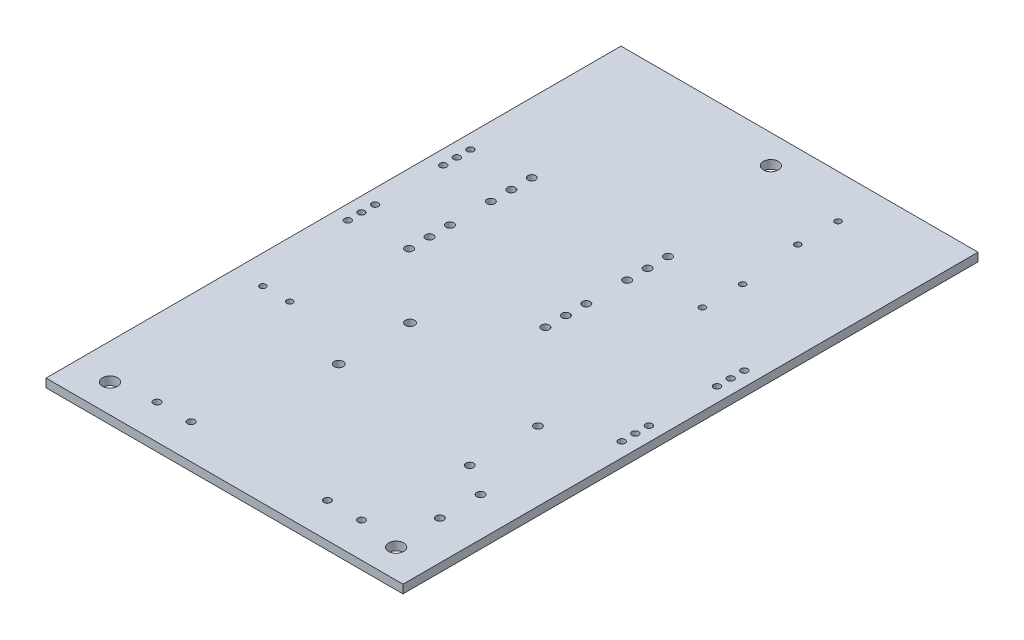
ISO-10303-21;
HEADER;
FILE_DESCRIPTION(('STEP AP214'),'2;1');
FILE_NAME('part.step','',(''),(''),'','','');
FILE_SCHEMA(('AUTOMOTIVE_DESIGN { 1 0 10303 214 1 1 1 1 }'));
ENDSEC;
DATA;
#1=APPLICATION_CONTEXT('core data for automotive mechanical design processes');
#2=APPLICATION_PROTOCOL_DEFINITION('international standard','automotive_design',2000,#1);
#3=PRODUCT_CONTEXT('',#1,'mechanical');
#4=PRODUCT('Part','Part','',(#3));
#5=PRODUCT_RELATED_PRODUCT_CATEGORY('part','',(#4));
#6=PRODUCT_DEFINITION_FORMATION('','',#4);
#7=PRODUCT_DEFINITION_CONTEXT('part definition',#1,'design');
#8=PRODUCT_DEFINITION('design','',#6,#7);
#9=PRODUCT_DEFINITION_SHAPE('','',#8);
#10=(LENGTH_UNIT() NAMED_UNIT(*) SI_UNIT(.MILLI.,.METRE.));
#11=(NAMED_UNIT(*) PLANE_ANGLE_UNIT() SI_UNIT($,.RADIAN.));
#12=(NAMED_UNIT(*) SI_UNIT($,.STERADIAN.) SOLID_ANGLE_UNIT());
#13=UNCERTAINTY_MEASURE_WITH_UNIT(LENGTH_MEASURE(1.E-05),#10,'distance_accuracy_value','');
#14=(GEOMETRIC_REPRESENTATION_CONTEXT(3) GLOBAL_UNCERTAINTY_ASSIGNED_CONTEXT((#13)) GLOBAL_UNIT_ASSIGNED_CONTEXT((#10,
#11,#12)) REPRESENTATION_CONTEXT('',''));
#15=CARTESIAN_POINT('',(0.,0.,0.));
#16=DIRECTION('',(0.,0.,1.));
#17=DIRECTION('',(1.,0.,0.));
#18=AXIS2_PLACEMENT_3D('',#15,#16,#17);
#19=CARTESIAN_POINT('',(-33.274,1.5748,-53.594));
#20=DIRECTION('',(1.,0.,0.));
#21=DIRECTION('',(0.,0.,-1.));
#22=AXIS2_PLACEMENT_3D('',#19,#20,#21);
#23=PLANE('',#22);
#24=DIRECTION('',(0.,0.,1.));
#25=VECTOR('',#24,1.);
#26=CARTESIAN_POINT('',(-33.274,0.,-53.594));
#27=LINE('',#26,#25);
#28=CARTESIAN_POINT('',(-33.274,0.,-53.594));
#29=VERTEX_POINT('',#28);
#30=CARTESIAN_POINT('',(-33.274,0.,53.594));
#31=VERTEX_POINT('',#30);
#32=EDGE_CURVE('E88',#29,#31,#27,.T.);
#33=ORIENTED_EDGE('',*,*,#32,.T.);
#34=DIRECTION('',(0.,-1.,0.));
#35=VECTOR('',#34,1.);
#36=CARTESIAN_POINT('',(-33.274,1.5748,53.594));
#37=LINE('',#36,#35);
#38=CARTESIAN_POINT('',(-33.274,1.5748,53.594));
#39=VERTEX_POINT('',#38);
#40=EDGE_CURVE('E13',#39,#31,#37,.T.);
#41=ORIENTED_EDGE('',*,*,#40,.F.);
#42=DIRECTION('',(0.,0.,1.));
#43=VECTOR('',#42,1.);
#44=CARTESIAN_POINT('',(-33.274,1.5748,-53.594));
#45=LINE('',#44,#43);
#46=CARTESIAN_POINT('',(-33.274,1.5748,-53.594));
#47=VERTEX_POINT('',#46);
#48=EDGE_CURVE('E111',#47,#39,#45,.T.);
#49=ORIENTED_EDGE('',*,*,#48,.F.);
#50=DIRECTION('',(0.,-1.,0.));
#51=VECTOR('',#50,1.);
#52=CARTESIAN_POINT('',(-33.274,1.5748,-53.594));
#53=LINE('',#52,#51);
#54=EDGE_CURVE('E100',#47,#29,#53,.T.);
#55=ORIENTED_EDGE('',*,*,#54,.T.);
#56=EDGE_LOOP('',(#33,#41,#49,#55));
#57=FACE_BOUND('',#56,.T.);
#58=ADVANCED_FACE('F44',(#57),#23,.F.);
#59=CARTESIAN_POINT('',(-33.274,1.5748,53.594));
#60=DIRECTION('',(0.,0.,-1.));
#61=DIRECTION('',(-1.,0.,0.));
#62=AXIS2_PLACEMENT_3D('',#59,#60,#61);
#63=PLANE('',#62);
#64=DIRECTION('',(1.,0.,0.));
#65=VECTOR('',#64,1.);
#66=CARTESIAN_POINT('',(-33.274,0.,53.594));
#67=LINE('',#66,#65);
#68=CARTESIAN_POINT('',(33.274,0.,53.594));
#69=VERTEX_POINT('',#68);
#70=EDGE_CURVE('E84',#31,#69,#67,.T.);
#71=ORIENTED_EDGE('',*,*,#70,.T.);
#72=DIRECTION('',(0.,-1.,0.));
#73=VECTOR('',#72,1.);
#74=CARTESIAN_POINT('',(33.274,1.5748,53.594));
#75=LINE('',#74,#73);
#76=CARTESIAN_POINT('',(33.274,1.5748,53.594));
#77=VERTEX_POINT('',#76);
#78=EDGE_CURVE('E51',#77,#69,#75,.T.);
#79=ORIENTED_EDGE('',*,*,#78,.F.);
#80=DIRECTION('',(1.,0.,0.));
#81=VECTOR('',#80,1.);
#82=CARTESIAN_POINT('',(-33.274,1.5748,53.594));
#83=LINE('',#82,#81);
#84=EDGE_CURVE('E96',#39,#77,#83,.T.);
#85=ORIENTED_EDGE('',*,*,#84,.F.);
#86=ORIENTED_EDGE('',*,*,#40,.T.);
#87=EDGE_LOOP('',(#71,#79,#85,#86));
#88=FACE_BOUND('',#87,.T.);
#89=ADVANCED_FACE('F95',(#88),#63,.F.);
#90=CARTESIAN_POINT('',(33.274,1.5748,-53.594));
#91=DIRECTION('',(-1.,0.,0.));
#92=DIRECTION('',(0.,0.,1.));
#93=AXIS2_PLACEMENT_3D('',#90,#91,#92);
#94=PLANE('',#93);
#95=DIRECTION('',(0.,0.,-1.));
#96=VECTOR('',#95,1.);
#97=CARTESIAN_POINT('',(33.274,0.,-53.594));
#98=LINE('',#97,#96);
#99=CARTESIAN_POINT('',(33.274,0.,-53.594));
#100=VERTEX_POINT('',#99);
#101=EDGE_CURVE('E89',#69,#100,#98,.T.);
#102=ORIENTED_EDGE('',*,*,#101,.T.);
#103=DIRECTION('',(0.,-1.,0.));
#104=VECTOR('',#103,1.);
#105=CARTESIAN_POINT('',(33.274,1.5748,-53.594));
#106=LINE('',#105,#104);
#107=CARTESIAN_POINT('',(33.274,1.5748,-53.594));
#108=VERTEX_POINT('',#107);
#109=EDGE_CURVE('E117',#108,#100,#106,.T.);
#110=ORIENTED_EDGE('',*,*,#109,.F.);
#111=DIRECTION('',(0.,0.,-1.));
#112=VECTOR('',#111,1.);
#113=CARTESIAN_POINT('',(33.274,1.5748,-53.594));
#114=LINE('',#113,#112);
#115=EDGE_CURVE('E63',#77,#108,#114,.T.);
#116=ORIENTED_EDGE('',*,*,#115,.F.);
#117=ORIENTED_EDGE('',*,*,#78,.T.);
#118=EDGE_LOOP('',(#102,#110,#116,#117));
#119=FACE_BOUND('',#118,.T.);
#120=ADVANCED_FACE('F120',(#119),#94,.F.);
#121=CARTESIAN_POINT('',(-33.274,1.5748,-53.594));
#122=DIRECTION('',(0.,0.,1.));
#123=DIRECTION('',(1.,0.,0.));
#124=AXIS2_PLACEMENT_3D('',#121,#122,#123);
#125=PLANE('',#124);
#126=DIRECTION('',(-1.,0.,0.));
#127=VECTOR('',#126,1.);
#128=CARTESIAN_POINT('',(-33.274,0.,-53.594));
#129=LINE('',#128,#127);
#130=EDGE_CURVE('E109',#100,#29,#129,.T.);
#131=ORIENTED_EDGE('',*,*,#130,.T.);
#132=ORIENTED_EDGE('',*,*,#54,.F.);
#133=DIRECTION('',(-1.,0.,0.));
#134=VECTOR('',#133,1.);
#135=CARTESIAN_POINT('',(-33.274,1.5748,-53.594));
#136=LINE('',#135,#134);
#137=EDGE_CURVE('E58',#108,#47,#136,.T.);
#138=ORIENTED_EDGE('',*,*,#137,.F.);
#139=ORIENTED_EDGE('',*,*,#109,.T.);
#140=EDGE_LOOP('',(#131,#132,#138,#139));
#141=FACE_BOUND('',#140,.T.);
#142=ADVANCED_FACE('F122',(#141),#125,.F.);
#143=CARTESIAN_POINT('',(-33.274,1.5748,53.594));
#144=DIRECTION('',(0.,1.,0.));
#145=DIRECTION('',(0.,0.,1.));
#146=AXIS2_PLACEMENT_3D('',#143,#144,#145);
#147=PLANE('',#146);
#148=CARTESIAN_POINT('',(-8.25500000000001,1.5748,10.7490006));
#149=DIRECTION('',(0.,1.,0.));
#150=DIRECTION('',(0.,0.,1.));
#151=AXIS2_PLACEMENT_3D('',#148,#149,#150);
#152=CIRCLE('',#151,0.8509);
#153=CARTESIAN_POINT('',(-8.25500000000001,1.5748,11.5999006));
#154=VERTEX_POINT('',#153);
#155=EDGE_CURVE('E599',#154,#154,#152,.T.);
#156=ORIENTED_EDGE('',*,*,#155,.F.);
#157=EDGE_LOOP('',(#156));
#158=FACE_BOUND('',#157,.T.);
#159=CARTESIAN_POINT('',(-8.25500000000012,1.5748,24.0489994));
#160=DIRECTION('',(0.,1.,0.));
#161=DIRECTION('',(0.,0.,1.));
#162=AXIS2_PLACEMENT_3D('',#159,#160,#161);
#163=CIRCLE('',#162,0.8509);
#164=CARTESIAN_POINT('',(-8.25500000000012,1.5748,24.8998994));
#165=VERTEX_POINT('',#164);
#166=EDGE_CURVE('E601',#165,#165,#163,.T.);
#167=ORIENTED_EDGE('',*,*,#166,.F.);
#168=EDGE_LOOP('',(#167));
#169=FACE_BOUND('',#168,.T.);
#170=CARTESIAN_POINT('',(26.035,1.5748,31.877));
#171=DIRECTION('',(0.,1.,0.));
#172=DIRECTION('',(0.,0.,1.));
#173=AXIS2_PLACEMENT_3D('',#170,#171,#172);
#174=CIRCLE('',#173,0.723899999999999);
#175=CARTESIAN_POINT('',(26.035,1.5748,32.6009));
#176=VERTEX_POINT('',#175);
#177=EDGE_CURVE('E607',#176,#176,#174,.T.);
#178=ORIENTED_EDGE('',*,*,#177,.F.);
#179=EDGE_LOOP('',(#178));
#180=FACE_BOUND('',#179,.T.);
#181=CARTESIAN_POINT('',(26.035,1.5748,39.497));
#182=DIRECTION('',(0.,1.,0.));
#183=DIRECTION('',(0.,0.,1.));
#184=AXIS2_PLACEMENT_3D('',#181,#182,#183);
#185=CIRCLE('',#184,0.723899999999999);
#186=CARTESIAN_POINT('',(26.035,1.5748,40.2209));
#187=VERTEX_POINT('',#186);
#188=EDGE_CURVE('E613',#187,#187,#185,.T.);
#189=ORIENTED_EDGE('',*,*,#188,.F.);
#190=EDGE_LOOP('',(#189));
#191=FACE_BOUND('',#190,.T.);
#192=CARTESIAN_POINT('',(20.32,1.5748,15.494));
#193=DIRECTION('',(0.,1.,0.));
#194=DIRECTION('',(0.,0.,1.));
#195=AXIS2_PLACEMENT_3D('',#192,#193,#194);
#196=CIRCLE('',#195,0.723899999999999);
#197=CARTESIAN_POINT('',(20.32,1.5748,16.2179));
#198=VERTEX_POINT('',#197);
#199=EDGE_CURVE('E619',#198,#198,#196,.T.);
#200=ORIENTED_EDGE('',*,*,#199,.F.);
#201=EDGE_LOOP('',(#200));
#202=FACE_BOUND('',#201,.T.);
#203=CARTESIAN_POINT('',(20.32,1.5748,28.194));
#204=DIRECTION('',(0.,1.,0.));
#205=DIRECTION('',(0.,0.,1.));
#206=AXIS2_PLACEMENT_3D('',#203,#204,#205);
#207=CIRCLE('',#206,0.723899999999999);
#208=CARTESIAN_POINT('',(20.32,1.5748,28.9179));
#209=VERTEX_POINT('',#208);
#210=EDGE_CURVE('E625',#209,#209,#207,.T.);
#211=ORIENTED_EDGE('',*,*,#210,.F.);
#212=EDGE_LOOP('',(#211));
#213=FACE_BOUND('',#212,.T.);
#214=CARTESIAN_POINT('',(-22.899995,1.5748,18.542));
#215=DIRECTION('',(0.,1.,0.));
#216=DIRECTION('',(0.,0.,1.));
#217=AXIS2_PLACEMENT_3D('',#214,#215,#216);
#218=CIRCLE('',#217,0.571499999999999);
#219=CARTESIAN_POINT('',(-22.899995,1.5748,19.1135));
#220=VERTEX_POINT('',#219);
#221=EDGE_CURVE('E631',#220,#220,#218,.T.);
#222=ORIENTED_EDGE('',*,*,#221,.F.);
#223=EDGE_LOOP('',(#222));
#224=FACE_BOUND('',#223,.T.);
#225=CARTESIAN_POINT('',(-27.899995,1.5748,18.542));
#226=DIRECTION('',(0.,1.,0.));
#227=DIRECTION('',(0.,0.,1.));
#228=AXIS2_PLACEMENT_3D('',#225,#226,#227);
#229=CIRCLE('',#228,0.571499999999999);
#230=CARTESIAN_POINT('',(-27.899995,1.5748,19.1135));
#231=VERTEX_POINT('',#230);
#232=EDGE_CURVE('E637',#231,#231,#229,.T.);
#233=ORIENTED_EDGE('',*,*,#232,.F.);
#234=EDGE_LOOP('',(#233));
#235=FACE_BOUND('',#234,.T.);
#236=CARTESIAN_POINT('',(15.24,1.5748,-45.5329948));
#237=DIRECTION('',(0.,1.,0.));
#238=DIRECTION('',(0.,0.,1.));
#239=AXIS2_PLACEMENT_3D('',#236,#237,#238);
#240=CIRCLE('',#239,0.571500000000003);
#241=CARTESIAN_POINT('',(15.24,1.5748,-44.9614948));
#242=VERTEX_POINT('',#241);
#243=EDGE_CURVE('E643',#242,#242,#240,.T.);
#244=ORIENTED_EDGE('',*,*,#243,.F.);
#245=EDGE_LOOP('',(#244));
#246=FACE_BOUND('',#245,.T.);
#247=CARTESIAN_POINT('',(15.24,1.5748,-38.0329948));
#248=DIRECTION('',(0.,1.,0.));
#249=DIRECTION('',(0.,0.,1.));
#250=AXIS2_PLACEMENT_3D('',#247,#248,#249);
#251=CIRCLE('',#250,0.571499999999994);
#252=CARTESIAN_POINT('',(15.24,1.5748,-37.4614948));
#253=VERTEX_POINT('',#252);
#254=EDGE_CURVE('E649',#253,#253,#251,.T.);
#255=ORIENTED_EDGE('',*,*,#254,.F.);
#256=EDGE_LOOP('',(#255));
#257=FACE_BOUND('',#256,.T.);
#258=CARTESIAN_POINT('',(16.51,1.5748,-26.4829948));
#259=DIRECTION('',(0.,1.,0.));
#260=DIRECTION('',(0.,0.,1.));
#261=AXIS2_PLACEMENT_3D('',#258,#259,#260);
#262=CIRCLE('',#261,0.571499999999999);
#263=CARTESIAN_POINT('',(16.51,1.5748,-25.9114948));
#264=VERTEX_POINT('',#263);
#265=EDGE_CURVE('E655',#264,#264,#262,.T.);
#266=ORIENTED_EDGE('',*,*,#265,.F.);
#267=EDGE_LOOP('',(#266));
#268=FACE_BOUND('',#267,.T.);
#269=CARTESIAN_POINT('',(16.51,1.5748,-18.9829948));
#270=DIRECTION('',(0.,1.,0.));
#271=DIRECTION('',(0.,0.,1.));
#272=AXIS2_PLACEMENT_3D('',#269,#270,#271);
#273=CIRCLE('',#272,0.571499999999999);
#274=CARTESIAN_POINT('',(16.51,1.5748,-18.4114948));
#275=VERTEX_POINT('',#274);
#276=EDGE_CURVE('E661',#275,#275,#273,.T.);
#277=ORIENTED_EDGE('',*,*,#276,.F.);
#278=EDGE_LOOP('',(#277));
#279=FACE_BOUND('',#278,.T.);
#280=CARTESIAN_POINT('',(5.08,1.5748,-1.143));
#281=DIRECTION('',(0.,1.,0.));
#282=DIRECTION('',(0.,0.,1.));
#283=AXIS2_PLACEMENT_3D('',#280,#281,#282);
#284=CIRCLE('',#283,0.723899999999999);
#285=CARTESIAN_POINT('',(5.08,1.5748,-0.419100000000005));
#286=VERTEX_POINT('',#285);
#287=EDGE_CURVE('E667',#286,#286,#284,.T.);
#288=ORIENTED_EDGE('',*,*,#287,.F.);
#289=EDGE_LOOP('',(#288));
#290=FACE_BOUND('',#289,.T.);
#291=CARTESIAN_POINT('',(5.08,1.5748,-4.953));
#292=DIRECTION('',(0.,1.,0.));
#293=DIRECTION('',(0.,0.,1.));
#294=AXIS2_PLACEMENT_3D('',#291,#292,#293);
#295=CIRCLE('',#294,0.723899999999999);
#296=CARTESIAN_POINT('',(5.08,1.5748,-4.2291));
#297=VERTEX_POINT('',#296);
#298=EDGE_CURVE('E673',#297,#297,#295,.T.);
#299=ORIENTED_EDGE('',*,*,#298,.F.);
#300=EDGE_LOOP('',(#299));
#301=FACE_BOUND('',#300,.T.);
#302=CARTESIAN_POINT('',(5.08,1.5748,-8.763));
#303=DIRECTION('',(0.,1.,0.));
#304=DIRECTION('',(0.,0.,1.));
#305=AXIS2_PLACEMENT_3D('',#302,#303,#304);
#306=CIRCLE('',#305,0.7239);
#307=CARTESIAN_POINT('',(5.08,1.5748,-8.0391));
#308=VERTEX_POINT('',#307);
#309=EDGE_CURVE('E679',#308,#308,#306,.T.);
#310=ORIENTED_EDGE('',*,*,#309,.F.);
#311=EDGE_LOOP('',(#310));
#312=FACE_BOUND('',#311,.T.);
#313=CARTESIAN_POINT('',(5.08,1.5748,-16.383));
#314=DIRECTION('',(0.,1.,0.));
#315=DIRECTION('',(0.,0.,1.));
#316=AXIS2_PLACEMENT_3D('',#313,#314,#315);
#317=CIRCLE('',#316,0.7239);
#318=CARTESIAN_POINT('',(5.08,1.5748,-15.6591));
#319=VERTEX_POINT('',#318);
#320=EDGE_CURVE('E685',#319,#319,#317,.T.);
#321=ORIENTED_EDGE('',*,*,#320,.F.);
#322=EDGE_LOOP('',(#321));
#323=FACE_BOUND('',#322,.T.);
#324=CARTESIAN_POINT('',(5.08,1.5748,-20.193));
#325=DIRECTION('',(0.,1.,0.));
#326=DIRECTION('',(0.,0.,1.));
#327=AXIS2_PLACEMENT_3D('',#324,#325,#326);
#328=CIRCLE('',#327,0.7239);
#329=CARTESIAN_POINT('',(5.08,1.5748,-19.4691));
#330=VERTEX_POINT('',#329);
#331=EDGE_CURVE('E691',#330,#330,#328,.T.);
#332=ORIENTED_EDGE('',*,*,#331,.F.);
#333=EDGE_LOOP('',(#332));
#334=FACE_BOUND('',#333,.T.);
#335=CARTESIAN_POINT('',(5.08,1.5748,-24.003));
#336=DIRECTION('',(0.,1.,0.));
#337=DIRECTION('',(0.,0.,1.));
#338=AXIS2_PLACEMENT_3D('',#335,#336,#337);
#339=CIRCLE('',#338,0.7239);
#340=CARTESIAN_POINT('',(5.08,1.5748,-23.2791));
#341=VERTEX_POINT('',#340);
#342=EDGE_CURVE('E697',#341,#341,#339,.T.);
#343=ORIENTED_EDGE('',*,*,#342,.F.);
#344=EDGE_LOOP('',(#343));
#345=FACE_BOUND('',#344,.T.);
#346=CARTESIAN_POINT('',(-20.32,1.5748,-1.143));
#347=DIRECTION('',(0.,1.,0.));
#348=DIRECTION('',(0.,0.,1.));
#349=AXIS2_PLACEMENT_3D('',#346,#347,#348);
#350=CIRCLE('',#349,0.723899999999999);
#351=CARTESIAN_POINT('',(-20.32,1.5748,-0.419100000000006));
#352=VERTEX_POINT('',#351);
#353=EDGE_CURVE('E703',#352,#352,#350,.T.);
#354=ORIENTED_EDGE('',*,*,#353,.F.);
#355=EDGE_LOOP('',(#354));
#356=FACE_BOUND('',#355,.T.);
#357=CARTESIAN_POINT('',(-20.32,1.5748,-4.953));
#358=DIRECTION('',(0.,1.,0.));
#359=DIRECTION('',(0.,0.,1.));
#360=AXIS2_PLACEMENT_3D('',#357,#358,#359);
#361=CIRCLE('',#360,0.723899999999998);
#362=CARTESIAN_POINT('',(-20.32,1.5748,-4.22910000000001));
#363=VERTEX_POINT('',#362);
#364=EDGE_CURVE('E709',#363,#363,#361,.T.);
#365=ORIENTED_EDGE('',*,*,#364,.F.);
#366=EDGE_LOOP('',(#365));
#367=FACE_BOUND('',#366,.T.);
#368=CARTESIAN_POINT('',(-20.32,1.5748,-8.763));
#369=DIRECTION('',(0.,1.,0.));
#370=DIRECTION('',(0.,0.,1.));
#371=AXIS2_PLACEMENT_3D('',#368,#369,#370);
#372=CIRCLE('',#371,0.723899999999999);
#373=CARTESIAN_POINT('',(-20.32,1.5748,-8.0391));
#374=VERTEX_POINT('',#373);
#375=EDGE_CURVE('E715',#374,#374,#372,.T.);
#376=ORIENTED_EDGE('',*,*,#375,.F.);
#377=EDGE_LOOP('',(#376));
#378=FACE_BOUND('',#377,.T.);
#379=CARTESIAN_POINT('',(-20.32,1.5748,-16.383));
#380=DIRECTION('',(0.,1.,0.));
#381=DIRECTION('',(0.,0.,1.));
#382=AXIS2_PLACEMENT_3D('',#379,#380,#381);
#383=CIRCLE('',#382,0.723899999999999);
#384=CARTESIAN_POINT('',(-20.32,1.5748,-15.6591));
#385=VERTEX_POINT('',#384);
#386=EDGE_CURVE('E721',#385,#385,#383,.T.);
#387=ORIENTED_EDGE('',*,*,#386,.F.);
#388=EDGE_LOOP('',(#387));
#389=FACE_BOUND('',#388,.T.);
#390=CARTESIAN_POINT('',(-20.32,1.5748,-20.193));
#391=DIRECTION('',(0.,1.,0.));
#392=DIRECTION('',(0.,0.,1.));
#393=AXIS2_PLACEMENT_3D('',#390,#391,#392);
#394=CIRCLE('',#393,0.723899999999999);
#395=CARTESIAN_POINT('',(-20.32,1.5748,-19.4691));
#396=VERTEX_POINT('',#395);
#397=EDGE_CURVE('E727',#396,#396,#394,.T.);
#398=ORIENTED_EDGE('',*,*,#397,.F.);
#399=EDGE_LOOP('',(#398));
#400=FACE_BOUND('',#399,.T.);
#401=CARTESIAN_POINT('',(-20.32,1.5748,-24.003));
#402=DIRECTION('',(0.,1.,0.));
#403=DIRECTION('',(0.,0.,1.));
#404=AXIS2_PLACEMENT_3D('',#401,#402,#403);
#405=CIRCLE('',#404,0.723899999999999);
#406=CARTESIAN_POINT('',(-20.32,1.5748,-23.2791));
#407=VERTEX_POINT('',#406);
#408=EDGE_CURVE('E733',#407,#407,#405,.T.);
#409=ORIENTED_EDGE('',*,*,#408,.F.);
#410=EDGE_LOOP('',(#409));
#411=FACE_BOUND('',#410,.T.);
#412=CARTESIAN_POINT('',(-30.607,1.5748,-20.32));
#413=DIRECTION('',(0.,1.,0.));
#414=DIRECTION('',(0.,0.,1.));
#415=AXIS2_PLACEMENT_3D('',#412,#413,#414);
#416=CIRCLE('',#415,0.622300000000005);
#417=CARTESIAN_POINT('',(-30.607,1.5748,-19.6977));
#418=VERTEX_POINT('',#417);
#419=EDGE_CURVE('E739',#418,#418,#416,.T.);
#420=ORIENTED_EDGE('',*,*,#419,.F.);
#421=EDGE_LOOP('',(#420));
#422=FACE_BOUND('',#421,.T.);
#423=CARTESIAN_POINT('',(-30.607,1.5748,-22.86));
#424=DIRECTION('',(0.,1.,0.));
#425=DIRECTION('',(0.,0.,1.));
#426=AXIS2_PLACEMENT_3D('',#423,#424,#425);
#427=CIRCLE('',#426,0.622300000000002);
#428=CARTESIAN_POINT('',(-30.607,1.5748,-22.2377));
#429=VERTEX_POINT('',#428);
#430=EDGE_CURVE('E747',#429,#429,#427,.T.);
#431=ORIENTED_EDGE('',*,*,#430,.F.);
#432=EDGE_LOOP('',(#431));
#433=FACE_BOUND('',#432,.T.);
#434=CARTESIAN_POINT('',(-30.607,1.5748,-17.78));
#435=DIRECTION('',(0.,1.,0.));
#436=DIRECTION('',(0.,0.,1.));
#437=AXIS2_PLACEMENT_3D('',#434,#435,#436);
#438=CIRCLE('',#437,0.622300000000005);
#439=CARTESIAN_POINT('',(-30.607,1.5748,-17.1577));
#440=VERTEX_POINT('',#439);
#441=EDGE_CURVE('E753',#440,#440,#438,.T.);
#442=ORIENTED_EDGE('',*,*,#441,.F.);
#443=EDGE_LOOP('',(#442));
#444=FACE_BOUND('',#443,.T.);
#445=CARTESIAN_POINT('',(-30.607,1.5748,-2.54));
#446=DIRECTION('',(0.,1.,0.));
#447=DIRECTION('',(0.,0.,1.));
#448=AXIS2_PLACEMENT_3D('',#445,#446,#447);
#449=CIRCLE('',#448,0.622300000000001);
#450=CARTESIAN_POINT('',(-30.607,1.5748,-1.9177));
#451=VERTEX_POINT('',#450);
#452=EDGE_CURVE('E759',#451,#451,#449,.T.);
#453=ORIENTED_EDGE('',*,*,#452,.F.);
#454=EDGE_LOOP('',(#453));
#455=FACE_BOUND('',#454,.T.);
#456=CARTESIAN_POINT('',(-30.607,1.5748,-5.08));
#457=DIRECTION('',(0.,1.,0.));
#458=DIRECTION('',(0.,0.,1.));
#459=AXIS2_PLACEMENT_3D('',#456,#457,#458);
#460=CIRCLE('',#459,0.622300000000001);
#461=CARTESIAN_POINT('',(-30.607,1.5748,-4.4577));
#462=VERTEX_POINT('',#461);
#463=EDGE_CURVE('E765',#462,#462,#460,.T.);
#464=ORIENTED_EDGE('',*,*,#463,.F.);
#465=EDGE_LOOP('',(#464));
#466=FACE_BOUND('',#465,.T.);
#467=CARTESIAN_POINT('',(-30.607,1.5748,0.));
#468=DIRECTION('',(0.,1.,0.));
#469=DIRECTION('',(0.,0.,1.));
#470=AXIS2_PLACEMENT_3D('',#467,#468,#469);
#471=CIRCLE('',#470,0.622300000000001);
#472=CARTESIAN_POINT('',(-30.607,1.5748,0.622300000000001));
#473=VERTEX_POINT('',#472);
#474=EDGE_CURVE('E771',#473,#473,#471,.T.);
#475=ORIENTED_EDGE('',*,*,#474,.F.);
#476=EDGE_LOOP('',(#475));
#477=FACE_BOUND('',#476,.T.);
#478=CARTESIAN_POINT('',(30.607,1.5748,-10.16));
#479=DIRECTION('',(0.,1.,0.));
#480=DIRECTION('',(0.,0.,1.));
#481=AXIS2_PLACEMENT_3D('',#478,#479,#480);
#482=CIRCLE('',#481,0.622300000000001);
#483=CARTESIAN_POINT('',(30.607,1.5748,-9.5377));
#484=VERTEX_POINT('',#483);
#485=EDGE_CURVE('E777',#484,#484,#482,.T.);
#486=ORIENTED_EDGE('',*,*,#485,.F.);
#487=EDGE_LOOP('',(#486));
#488=FACE_BOUND('',#487,.T.);
#489=CARTESIAN_POINT('',(30.607,1.5748,-12.7));
#490=DIRECTION('',(0.,1.,0.));
#491=DIRECTION('',(0.,0.,1.));
#492=AXIS2_PLACEMENT_3D('',#489,#490,#491);
#493=CIRCLE('',#492,0.622300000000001);
#494=CARTESIAN_POINT('',(30.607,1.5748,-12.0777));
#495=VERTEX_POINT('',#494);
#496=EDGE_CURVE('E783',#495,#495,#493,.T.);
#497=ORIENTED_EDGE('',*,*,#496,.F.);
#498=EDGE_LOOP('',(#497));
#499=FACE_BOUND('',#498,.T.);
#500=CARTESIAN_POINT('',(30.607,1.5748,-7.62000000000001));
#501=DIRECTION('',(0.,1.,0.));
#502=DIRECTION('',(0.,0.,1.));
#503=AXIS2_PLACEMENT_3D('',#500,#501,#502);
#504=CIRCLE('',#503,0.622300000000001);
#505=CARTESIAN_POINT('',(30.607,1.5748,-6.9977));
#506=VERTEX_POINT('',#505);
#507=EDGE_CURVE('E789',#506,#506,#504,.T.);
#508=ORIENTED_EDGE('',*,*,#507,.F.);
#509=EDGE_LOOP('',(#508));
#510=FACE_BOUND('',#509,.T.);
#511=CARTESIAN_POINT('',(30.607,1.5748,7.61999999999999));
#512=DIRECTION('',(0.,1.,0.));
#513=DIRECTION('',(0.,0.,1.));
#514=AXIS2_PLACEMENT_3D('',#511,#512,#513);
#515=CIRCLE('',#514,0.622300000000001);
#516=CARTESIAN_POINT('',(30.607,1.5748,8.2423));
#517=VERTEX_POINT('',#516);
#518=EDGE_CURVE('E795',#517,#517,#515,.T.);
#519=ORIENTED_EDGE('',*,*,#518,.F.);
#520=EDGE_LOOP('',(#519));
#521=FACE_BOUND('',#520,.T.);
#522=CARTESIAN_POINT('',(30.607,1.5748,5.07999999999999));
#523=DIRECTION('',(0.,1.,0.));
#524=DIRECTION('',(0.,0.,1.));
#525=AXIS2_PLACEMENT_3D('',#522,#523,#524);
#526=CIRCLE('',#525,0.622300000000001);
#527=CARTESIAN_POINT('',(30.607,1.5748,5.70229999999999));
#528=VERTEX_POINT('',#527);
#529=EDGE_CURVE('E801',#528,#528,#526,.T.);
#530=ORIENTED_EDGE('',*,*,#529,.F.);
#531=EDGE_LOOP('',(#530));
#532=FACE_BOUND('',#531,.T.);
#533=CARTESIAN_POINT('',(30.607,1.5748,10.16));
#534=DIRECTION('',(0.,1.,0.));
#535=DIRECTION('',(0.,0.,1.));
#536=AXIS2_PLACEMENT_3D('',#533,#534,#535);
#537=CIRCLE('',#536,0.622300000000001);
#538=CARTESIAN_POINT('',(30.607,1.5748,10.7823));
#539=VERTEX_POINT('',#538);
#540=EDGE_CURVE('E807',#539,#539,#537,.T.);
#541=ORIENTED_EDGE('',*,*,#540,.F.);
#542=EDGE_LOOP('',(#541));
#543=FACE_BOUND('',#542,.T.);
#544=CARTESIAN_POINT('',(-19.05,1.5748,47.117));
#545=DIRECTION('',(0.,1.,0.));
#546=DIRECTION('',(0.,0.,-1.));
#547=AXIS2_PLACEMENT_3D('',#544,#545,#546);
#548=CIRCLE('',#547,0.660399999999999);
#549=CARTESIAN_POINT('',(-19.05,1.5748,46.4566));
#550=VERTEX_POINT('',#549);
#551=EDGE_CURVE('E813',#550,#550,#548,.T.);
#552=ORIENTED_EDGE('',*,*,#551,.F.);
#553=EDGE_LOOP('',(#552));
#554=FACE_BOUND('',#553,.T.);
#555=CARTESIAN_POINT('',(-12.7,1.5748,47.117));
#556=DIRECTION('',(0.,1.,0.));
#557=DIRECTION('',(0.,0.,-1.));
#558=AXIS2_PLACEMENT_3D('',#555,#556,#557);
#559=CIRCLE('',#558,0.660400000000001);
#560=CARTESIAN_POINT('',(-12.7,1.5748,46.4566));
#561=VERTEX_POINT('',#560);
#562=EDGE_CURVE('E819',#561,#561,#559,.T.);
#563=ORIENTED_EDGE('',*,*,#562,.F.);
#564=EDGE_LOOP('',(#563));
#565=FACE_BOUND('',#564,.T.);
#566=CARTESIAN_POINT('',(12.7,1.5748,47.117));
#567=DIRECTION('',(0.,1.,0.));
#568=DIRECTION('',(0.,0.,1.));
#569=AXIS2_PLACEMENT_3D('',#566,#567,#568);
#570=CIRCLE('',#569,0.660400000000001);
#571=CARTESIAN_POINT('',(12.7,1.5748,47.7774));
#572=VERTEX_POINT('',#571);
#573=EDGE_CURVE('E825',#572,#572,#570,.T.);
#574=ORIENTED_EDGE('',*,*,#573,.F.);
#575=EDGE_LOOP('',(#574));
#576=FACE_BOUND('',#575,.T.);
#577=CARTESIAN_POINT('',(19.05,1.5748,47.117));
#578=DIRECTION('',(0.,1.,0.));
#579=DIRECTION('',(0.,0.,1.));
#580=AXIS2_PLACEMENT_3D('',#577,#578,#579);
#581=CIRCLE('',#580,0.660399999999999);
#582=CARTESIAN_POINT('',(19.05,1.5748,47.7774));
#583=VERTEX_POINT('',#582);
#584=EDGE_CURVE('E831',#583,#583,#581,.T.);
#585=ORIENTED_EDGE('',*,*,#584,.F.);
#586=EDGE_LOOP('',(#585));
#587=FACE_BOUND('',#586,.T.);
#588=CARTESIAN_POINT('',(0.,1.5748,-48.26));
#589=DIRECTION('',(0.,1.,0.));
#590=DIRECTION('',(0.,0.,1.));
#591=AXIS2_PLACEMENT_3D('',#588,#589,#590);
#592=CIRCLE('',#591,1.397);
#593=CARTESIAN_POINT('',(0.,1.5748,-46.863));
#594=VERTEX_POINT('',#593);
#595=EDGE_CURVE('E837',#594,#594,#592,.T.);
#596=ORIENTED_EDGE('',*,*,#595,.F.);
#597=EDGE_LOOP('',(#596));
#598=FACE_BOUND('',#597,.T.);
#599=CARTESIAN_POINT('',(26.67,1.5748,48.26));
#600=DIRECTION('',(0.,1.,0.));
#601=DIRECTION('',(0.,0.,1.));
#602=AXIS2_PLACEMENT_3D('',#599,#600,#601);
#603=CIRCLE('',#602,1.397);
#604=CARTESIAN_POINT('',(26.67,1.5748,49.657));
#605=VERTEX_POINT('',#604);
#606=EDGE_CURVE('E843',#605,#605,#603,.T.);
#607=ORIENTED_EDGE('',*,*,#606,.F.);
#608=EDGE_LOOP('',(#607));
#609=FACE_BOUND('',#608,.T.);
#610=CARTESIAN_POINT('',(-26.67,1.5748,48.26));
#611=DIRECTION('',(0.,1.,0.));
#612=DIRECTION('',(0.,0.,1.));
#613=AXIS2_PLACEMENT_3D('',#610,#611,#612);
#614=CIRCLE('',#613,1.397);
#615=CARTESIAN_POINT('',(-26.67,1.5748,49.657));
#616=VERTEX_POINT('',#615);
#617=EDGE_CURVE('E104',#616,#616,#614,.T.);
#618=ORIENTED_EDGE('',*,*,#617,.F.);
#619=EDGE_LOOP('',(#618));
#620=FACE_BOUND('',#619,.T.);
#621=ORIENTED_EDGE('',*,*,#48,.T.);
#622=ORIENTED_EDGE('',*,*,#84,.T.);
#623=ORIENTED_EDGE('',*,*,#115,.T.);
#624=ORIENTED_EDGE('',*,*,#137,.T.);
#625=EDGE_LOOP('',(#621,#622,#623,#624));
#626=FACE_BOUND('',#625,.T.);
#627=ADVANCED_FACE('F123',(#158,#169,#180,#191,#202,#213,#224,#235,#246,#257,#268,#279,#290,
#301,#312,#323,#334,#345,#356,#367,#378,#389,#400,#411,#422,#433,#444,#455,#466,#477,#488,#499,
#510,#521,#532,#543,#554,#565,#576,#587,#598,#609,#620,#626),#147,.T.);
#628=CARTESIAN_POINT('',(-33.274,0.,53.594));
#629=DIRECTION('',(0.,1.,0.));
#630=DIRECTION('',(0.,0.,1.));
#631=AXIS2_PLACEMENT_3D('',#628,#629,#630);
#632=PLANE('',#631);
#633=CARTESIAN_POINT('',(-8.25500000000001,0.,10.7490006));
#634=DIRECTION('',(0.,1.,0.));
#635=DIRECTION('',(0.,0.,1.));
#636=AXIS2_PLACEMENT_3D('',#633,#634,#635);
#637=CIRCLE('',#636,0.8509);
#638=CARTESIAN_POINT('',(-8.25500000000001,0.,11.5999006));
#639=VERTEX_POINT('',#638);
#640=EDGE_CURVE('E597',#639,#639,#637,.T.);
#641=ORIENTED_EDGE('',*,*,#640,.T.);
#642=EDGE_LOOP('',(#641));
#643=FACE_BOUND('',#642,.T.);
#644=CARTESIAN_POINT('',(-8.25500000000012,0.,24.0489994));
#645=DIRECTION('',(0.,1.,0.));
#646=DIRECTION('',(0.,0.,1.));
#647=AXIS2_PLACEMENT_3D('',#644,#645,#646);
#648=CIRCLE('',#647,0.8509);
#649=CARTESIAN_POINT('',(-8.25500000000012,0.,24.8998994));
#650=VERTEX_POINT('',#649);
#651=EDGE_CURVE('E604',#650,#650,#648,.T.);
#652=ORIENTED_EDGE('',*,*,#651,.T.);
#653=EDGE_LOOP('',(#652));
#654=FACE_BOUND('',#653,.T.);
#655=CARTESIAN_POINT('',(26.035,0.,31.877));
#656=DIRECTION('',(0.,1.,0.));
#657=DIRECTION('',(0.,0.,1.));
#658=AXIS2_PLACEMENT_3D('',#655,#656,#657);
#659=CIRCLE('',#658,0.723899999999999);
#660=CARTESIAN_POINT('',(26.035,0.,32.6009));
#661=VERTEX_POINT('',#660);
#662=EDGE_CURVE('E610',#661,#661,#659,.T.);
#663=ORIENTED_EDGE('',*,*,#662,.T.);
#664=EDGE_LOOP('',(#663));
#665=FACE_BOUND('',#664,.T.);
#666=CARTESIAN_POINT('',(26.035,0.,39.497));
#667=DIRECTION('',(0.,1.,0.));
#668=DIRECTION('',(0.,0.,1.));
#669=AXIS2_PLACEMENT_3D('',#666,#667,#668);
#670=CIRCLE('',#669,0.723899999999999);
#671=CARTESIAN_POINT('',(26.035,0.,40.2209));
#672=VERTEX_POINT('',#671);
#673=EDGE_CURVE('E616',#672,#672,#670,.T.);
#674=ORIENTED_EDGE('',*,*,#673,.T.);
#675=EDGE_LOOP('',(#674));
#676=FACE_BOUND('',#675,.T.);
#677=CARTESIAN_POINT('',(20.32,0.,15.494));
#678=DIRECTION('',(0.,1.,0.));
#679=DIRECTION('',(0.,0.,1.));
#680=AXIS2_PLACEMENT_3D('',#677,#678,#679);
#681=CIRCLE('',#680,0.723899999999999);
#682=CARTESIAN_POINT('',(20.32,0.,16.2179));
#683=VERTEX_POINT('',#682);
#684=EDGE_CURVE('E622',#683,#683,#681,.T.);
#685=ORIENTED_EDGE('',*,*,#684,.T.);
#686=EDGE_LOOP('',(#685));
#687=FACE_BOUND('',#686,.T.);
#688=CARTESIAN_POINT('',(20.32,0.,28.194));
#689=DIRECTION('',(0.,1.,0.));
#690=DIRECTION('',(0.,0.,1.));
#691=AXIS2_PLACEMENT_3D('',#688,#689,#690);
#692=CIRCLE('',#691,0.723899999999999);
#693=CARTESIAN_POINT('',(20.32,0.,28.9179));
#694=VERTEX_POINT('',#693);
#695=EDGE_CURVE('E628',#694,#694,#692,.T.);
#696=ORIENTED_EDGE('',*,*,#695,.T.);
#697=EDGE_LOOP('',(#696));
#698=FACE_BOUND('',#697,.T.);
#699=CARTESIAN_POINT('',(-22.899995,0.,18.542));
#700=DIRECTION('',(0.,1.,0.));
#701=DIRECTION('',(0.,0.,1.));
#702=AXIS2_PLACEMENT_3D('',#699,#700,#701);
#703=CIRCLE('',#702,0.571499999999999);
#704=CARTESIAN_POINT('',(-22.899995,0.,19.1135));
#705=VERTEX_POINT('',#704);
#706=EDGE_CURVE('E634',#705,#705,#703,.T.);
#707=ORIENTED_EDGE('',*,*,#706,.T.);
#708=EDGE_LOOP('',(#707));
#709=FACE_BOUND('',#708,.T.);
#710=CARTESIAN_POINT('',(-27.899995,0.,18.542));
#711=DIRECTION('',(0.,1.,0.));
#712=DIRECTION('',(0.,0.,1.));
#713=AXIS2_PLACEMENT_3D('',#710,#711,#712);
#714=CIRCLE('',#713,0.571499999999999);
#715=CARTESIAN_POINT('',(-27.899995,0.,19.1135));
#716=VERTEX_POINT('',#715);
#717=EDGE_CURVE('E640',#716,#716,#714,.T.);
#718=ORIENTED_EDGE('',*,*,#717,.T.);
#719=EDGE_LOOP('',(#718));
#720=FACE_BOUND('',#719,.T.);
#721=CARTESIAN_POINT('',(15.24,0.,-45.5329948));
#722=DIRECTION('',(0.,1.,0.));
#723=DIRECTION('',(0.,0.,1.));
#724=AXIS2_PLACEMENT_3D('',#721,#722,#723);
#725=CIRCLE('',#724,0.571500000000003);
#726=CARTESIAN_POINT('',(15.24,0.,-44.9614948));
#727=VERTEX_POINT('',#726);
#728=EDGE_CURVE('E646',#727,#727,#725,.T.);
#729=ORIENTED_EDGE('',*,*,#728,.T.);
#730=EDGE_LOOP('',(#729));
#731=FACE_BOUND('',#730,.T.);
#732=CARTESIAN_POINT('',(15.24,0.,-38.0329948));
#733=DIRECTION('',(0.,1.,0.));
#734=DIRECTION('',(0.,0.,1.));
#735=AXIS2_PLACEMENT_3D('',#732,#733,#734);
#736=CIRCLE('',#735,0.571499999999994);
#737=CARTESIAN_POINT('',(15.24,0.,-37.4614948));
#738=VERTEX_POINT('',#737);
#739=EDGE_CURVE('E652',#738,#738,#736,.T.);
#740=ORIENTED_EDGE('',*,*,#739,.T.);
#741=EDGE_LOOP('',(#740));
#742=FACE_BOUND('',#741,.T.);
#743=CARTESIAN_POINT('',(16.51,0.,-26.4829948));
#744=DIRECTION('',(0.,1.,0.));
#745=DIRECTION('',(0.,0.,1.));
#746=AXIS2_PLACEMENT_3D('',#743,#744,#745);
#747=CIRCLE('',#746,0.571499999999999);
#748=CARTESIAN_POINT('',(16.51,0.,-25.9114948));
#749=VERTEX_POINT('',#748);
#750=EDGE_CURVE('E658',#749,#749,#747,.T.);
#751=ORIENTED_EDGE('',*,*,#750,.T.);
#752=EDGE_LOOP('',(#751));
#753=FACE_BOUND('',#752,.T.);
#754=CARTESIAN_POINT('',(16.51,0.,-18.9829948));
#755=DIRECTION('',(0.,1.,0.));
#756=DIRECTION('',(0.,0.,1.));
#757=AXIS2_PLACEMENT_3D('',#754,#755,#756);
#758=CIRCLE('',#757,0.571499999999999);
#759=CARTESIAN_POINT('',(16.51,0.,-18.4114948));
#760=VERTEX_POINT('',#759);
#761=EDGE_CURVE('E664',#760,#760,#758,.T.);
#762=ORIENTED_EDGE('',*,*,#761,.T.);
#763=EDGE_LOOP('',(#762));
#764=FACE_BOUND('',#763,.T.);
#765=CARTESIAN_POINT('',(5.08,0.,-1.143));
#766=DIRECTION('',(0.,1.,0.));
#767=DIRECTION('',(0.,0.,1.));
#768=AXIS2_PLACEMENT_3D('',#765,#766,#767);
#769=CIRCLE('',#768,0.723899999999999);
#770=CARTESIAN_POINT('',(5.08,0.,-0.419100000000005));
#771=VERTEX_POINT('',#770);
#772=EDGE_CURVE('E670',#771,#771,#769,.T.);
#773=ORIENTED_EDGE('',*,*,#772,.T.);
#774=EDGE_LOOP('',(#773));
#775=FACE_BOUND('',#774,.T.);
#776=CARTESIAN_POINT('',(5.08,0.,-4.953));
#777=DIRECTION('',(0.,1.,0.));
#778=DIRECTION('',(0.,0.,1.));
#779=AXIS2_PLACEMENT_3D('',#776,#777,#778);
#780=CIRCLE('',#779,0.723899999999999);
#781=CARTESIAN_POINT('',(5.08,0.,-4.2291));
#782=VERTEX_POINT('',#781);
#783=EDGE_CURVE('E676',#782,#782,#780,.T.);
#784=ORIENTED_EDGE('',*,*,#783,.T.);
#785=EDGE_LOOP('',(#784));
#786=FACE_BOUND('',#785,.T.);
#787=CARTESIAN_POINT('',(5.08,0.,-8.763));
#788=DIRECTION('',(0.,1.,0.));
#789=DIRECTION('',(0.,0.,1.));
#790=AXIS2_PLACEMENT_3D('',#787,#788,#789);
#791=CIRCLE('',#790,0.7239);
#792=CARTESIAN_POINT('',(5.08,0.,-8.0391));
#793=VERTEX_POINT('',#792);
#794=EDGE_CURVE('E682',#793,#793,#791,.T.);
#795=ORIENTED_EDGE('',*,*,#794,.T.);
#796=EDGE_LOOP('',(#795));
#797=FACE_BOUND('',#796,.T.);
#798=CARTESIAN_POINT('',(5.08,0.,-16.383));
#799=DIRECTION('',(0.,1.,0.));
#800=DIRECTION('',(0.,0.,1.));
#801=AXIS2_PLACEMENT_3D('',#798,#799,#800);
#802=CIRCLE('',#801,0.7239);
#803=CARTESIAN_POINT('',(5.08,0.,-15.6591));
#804=VERTEX_POINT('',#803);
#805=EDGE_CURVE('E688',#804,#804,#802,.T.);
#806=ORIENTED_EDGE('',*,*,#805,.T.);
#807=EDGE_LOOP('',(#806));
#808=FACE_BOUND('',#807,.T.);
#809=CARTESIAN_POINT('',(5.08,0.,-20.193));
#810=DIRECTION('',(0.,1.,0.));
#811=DIRECTION('',(0.,0.,1.));
#812=AXIS2_PLACEMENT_3D('',#809,#810,#811);
#813=CIRCLE('',#812,0.7239);
#814=CARTESIAN_POINT('',(5.08,0.,-19.4691));
#815=VERTEX_POINT('',#814);
#816=EDGE_CURVE('E694',#815,#815,#813,.T.);
#817=ORIENTED_EDGE('',*,*,#816,.T.);
#818=EDGE_LOOP('',(#817));
#819=FACE_BOUND('',#818,.T.);
#820=CARTESIAN_POINT('',(5.08,0.,-24.003));
#821=DIRECTION('',(0.,1.,0.));
#822=DIRECTION('',(0.,0.,1.));
#823=AXIS2_PLACEMENT_3D('',#820,#821,#822);
#824=CIRCLE('',#823,0.7239);
#825=CARTESIAN_POINT('',(5.08,0.,-23.2791));
#826=VERTEX_POINT('',#825);
#827=EDGE_CURVE('E700',#826,#826,#824,.T.);
#828=ORIENTED_EDGE('',*,*,#827,.T.);
#829=EDGE_LOOP('',(#828));
#830=FACE_BOUND('',#829,.T.);
#831=CARTESIAN_POINT('',(-20.32,0.,-1.143));
#832=DIRECTION('',(0.,1.,0.));
#833=DIRECTION('',(0.,0.,1.));
#834=AXIS2_PLACEMENT_3D('',#831,#832,#833);
#835=CIRCLE('',#834,0.723899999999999);
#836=CARTESIAN_POINT('',(-20.32,0.,-0.419100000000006));
#837=VERTEX_POINT('',#836);
#838=EDGE_CURVE('E706',#837,#837,#835,.T.);
#839=ORIENTED_EDGE('',*,*,#838,.T.);
#840=EDGE_LOOP('',(#839));
#841=FACE_BOUND('',#840,.T.);
#842=CARTESIAN_POINT('',(-20.32,0.,-4.953));
#843=DIRECTION('',(0.,1.,0.));
#844=DIRECTION('',(0.,0.,1.));
#845=AXIS2_PLACEMENT_3D('',#842,#843,#844);
#846=CIRCLE('',#845,0.723899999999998);
#847=CARTESIAN_POINT('',(-20.32,0.,-4.22910000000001));
#848=VERTEX_POINT('',#847);
#849=EDGE_CURVE('E712',#848,#848,#846,.T.);
#850=ORIENTED_EDGE('',*,*,#849,.T.);
#851=EDGE_LOOP('',(#850));
#852=FACE_BOUND('',#851,.T.);
#853=CARTESIAN_POINT('',(-20.32,0.,-8.763));
#854=DIRECTION('',(0.,1.,0.));
#855=DIRECTION('',(0.,0.,1.));
#856=AXIS2_PLACEMENT_3D('',#853,#854,#855);
#857=CIRCLE('',#856,0.723899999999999);
#858=CARTESIAN_POINT('',(-20.32,0.,-8.0391));
#859=VERTEX_POINT('',#858);
#860=EDGE_CURVE('E718',#859,#859,#857,.T.);
#861=ORIENTED_EDGE('',*,*,#860,.T.);
#862=EDGE_LOOP('',(#861));
#863=FACE_BOUND('',#862,.T.);
#864=CARTESIAN_POINT('',(-20.32,0.,-16.383));
#865=DIRECTION('',(0.,1.,0.));
#866=DIRECTION('',(0.,0.,1.));
#867=AXIS2_PLACEMENT_3D('',#864,#865,#866);
#868=CIRCLE('',#867,0.723899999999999);
#869=CARTESIAN_POINT('',(-20.32,0.,-15.6591));
#870=VERTEX_POINT('',#869);
#871=EDGE_CURVE('E724',#870,#870,#868,.T.);
#872=ORIENTED_EDGE('',*,*,#871,.T.);
#873=EDGE_LOOP('',(#872));
#874=FACE_BOUND('',#873,.T.);
#875=CARTESIAN_POINT('',(-20.32,0.,-20.193));
#876=DIRECTION('',(0.,1.,0.));
#877=DIRECTION('',(0.,0.,1.));
#878=AXIS2_PLACEMENT_3D('',#875,#876,#877);
#879=CIRCLE('',#878,0.723899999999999);
#880=CARTESIAN_POINT('',(-20.32,0.,-19.4691));
#881=VERTEX_POINT('',#880);
#882=EDGE_CURVE('E730',#881,#881,#879,.T.);
#883=ORIENTED_EDGE('',*,*,#882,.T.);
#884=EDGE_LOOP('',(#883));
#885=FACE_BOUND('',#884,.T.);
#886=CARTESIAN_POINT('',(-20.32,0.,-24.003));
#887=DIRECTION('',(0.,1.,0.));
#888=DIRECTION('',(0.,0.,1.));
#889=AXIS2_PLACEMENT_3D('',#886,#887,#888);
#890=CIRCLE('',#889,0.723899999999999);
#891=CARTESIAN_POINT('',(-20.32,0.,-23.2791));
#892=VERTEX_POINT('',#891);
#893=EDGE_CURVE('E736',#892,#892,#890,.T.);
#894=ORIENTED_EDGE('',*,*,#893,.T.);
#895=EDGE_LOOP('',(#894));
#896=FACE_BOUND('',#895,.T.);
#897=CARTESIAN_POINT('',(-30.607,0.,-20.32));
#898=DIRECTION('',(0.,1.,0.));
#899=DIRECTION('',(0.,0.,1.));
#900=AXIS2_PLACEMENT_3D('',#897,#898,#899);
#901=CIRCLE('',#900,0.622300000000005);
#902=CARTESIAN_POINT('',(-30.607,0.,-19.6977));
#903=VERTEX_POINT('',#902);
#904=EDGE_CURVE('E744',#903,#903,#901,.T.);
#905=ORIENTED_EDGE('',*,*,#904,.T.);
#906=EDGE_LOOP('',(#905));
#907=FACE_BOUND('',#906,.T.);
#908=CARTESIAN_POINT('',(-30.607,0.,-22.86));
#909=DIRECTION('',(0.,1.,0.));
#910=DIRECTION('',(0.,0.,1.));
#911=AXIS2_PLACEMENT_3D('',#908,#909,#910);
#912=CIRCLE('',#911,0.622300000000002);
#913=CARTESIAN_POINT('',(-30.607,0.,-22.2377));
#914=VERTEX_POINT('',#913);
#915=EDGE_CURVE('E750',#914,#914,#912,.T.);
#916=ORIENTED_EDGE('',*,*,#915,.T.);
#917=EDGE_LOOP('',(#916));
#918=FACE_BOUND('',#917,.T.);
#919=CARTESIAN_POINT('',(-30.607,0.,-17.78));
#920=DIRECTION('',(0.,1.,0.));
#921=DIRECTION('',(0.,0.,1.));
#922=AXIS2_PLACEMENT_3D('',#919,#920,#921);
#923=CIRCLE('',#922,0.622300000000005);
#924=CARTESIAN_POINT('',(-30.607,0.,-17.1577));
#925=VERTEX_POINT('',#924);
#926=EDGE_CURVE('E756',#925,#925,#923,.T.);
#927=ORIENTED_EDGE('',*,*,#926,.T.);
#928=EDGE_LOOP('',(#927));
#929=FACE_BOUND('',#928,.T.);
#930=CARTESIAN_POINT('',(-30.607,0.,-2.54));
#931=DIRECTION('',(0.,1.,0.));
#932=DIRECTION('',(0.,0.,1.));
#933=AXIS2_PLACEMENT_3D('',#930,#931,#932);
#934=CIRCLE('',#933,0.622300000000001);
#935=CARTESIAN_POINT('',(-30.607,0.,-1.9177));
#936=VERTEX_POINT('',#935);
#937=EDGE_CURVE('E762',#936,#936,#934,.T.);
#938=ORIENTED_EDGE('',*,*,#937,.T.);
#939=EDGE_LOOP('',(#938));
#940=FACE_BOUND('',#939,.T.);
#941=CARTESIAN_POINT('',(-30.607,0.,-5.08));
#942=DIRECTION('',(0.,1.,0.));
#943=DIRECTION('',(0.,0.,1.));
#944=AXIS2_PLACEMENT_3D('',#941,#942,#943);
#945=CIRCLE('',#944,0.622300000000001);
#946=CARTESIAN_POINT('',(-30.607,0.,-4.4577));
#947=VERTEX_POINT('',#946);
#948=EDGE_CURVE('E768',#947,#947,#945,.T.);
#949=ORIENTED_EDGE('',*,*,#948,.T.);
#950=EDGE_LOOP('',(#949));
#951=FACE_BOUND('',#950,.T.);
#952=CARTESIAN_POINT('',(-30.607,0.,0.));
#953=DIRECTION('',(0.,1.,0.));
#954=DIRECTION('',(0.,0.,1.));
#955=AXIS2_PLACEMENT_3D('',#952,#953,#954);
#956=CIRCLE('',#955,0.622300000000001);
#957=CARTESIAN_POINT('',(-30.607,0.,0.622300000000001));
#958=VERTEX_POINT('',#957);
#959=EDGE_CURVE('E774',#958,#958,#956,.T.);
#960=ORIENTED_EDGE('',*,*,#959,.T.);
#961=EDGE_LOOP('',(#960));
#962=FACE_BOUND('',#961,.T.);
#963=CARTESIAN_POINT('',(30.607,0.,-10.16));
#964=DIRECTION('',(0.,1.,0.));
#965=DIRECTION('',(0.,0.,1.));
#966=AXIS2_PLACEMENT_3D('',#963,#964,#965);
#967=CIRCLE('',#966,0.622300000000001);
#968=CARTESIAN_POINT('',(30.607,0.,-9.5377));
#969=VERTEX_POINT('',#968);
#970=EDGE_CURVE('E780',#969,#969,#967,.T.);
#971=ORIENTED_EDGE('',*,*,#970,.T.);
#972=EDGE_LOOP('',(#971));
#973=FACE_BOUND('',#972,.T.);
#974=CARTESIAN_POINT('',(30.607,0.,-12.7));
#975=DIRECTION('',(0.,1.,0.));
#976=DIRECTION('',(0.,0.,1.));
#977=AXIS2_PLACEMENT_3D('',#974,#975,#976);
#978=CIRCLE('',#977,0.622300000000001);
#979=CARTESIAN_POINT('',(30.607,0.,-12.0777));
#980=VERTEX_POINT('',#979);
#981=EDGE_CURVE('E786',#980,#980,#978,.T.);
#982=ORIENTED_EDGE('',*,*,#981,.T.);
#983=EDGE_LOOP('',(#982));
#984=FACE_BOUND('',#983,.T.);
#985=CARTESIAN_POINT('',(30.607,0.,-7.62000000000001));
#986=DIRECTION('',(0.,1.,0.));
#987=DIRECTION('',(0.,0.,1.));
#988=AXIS2_PLACEMENT_3D('',#985,#986,#987);
#989=CIRCLE('',#988,0.622300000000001);
#990=CARTESIAN_POINT('',(30.607,0.,-6.9977));
#991=VERTEX_POINT('',#990);
#992=EDGE_CURVE('E792',#991,#991,#989,.T.);
#993=ORIENTED_EDGE('',*,*,#992,.T.);
#994=EDGE_LOOP('',(#993));
#995=FACE_BOUND('',#994,.T.);
#996=CARTESIAN_POINT('',(30.607,0.,7.61999999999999));
#997=DIRECTION('',(0.,1.,0.));
#998=DIRECTION('',(0.,0.,1.));
#999=AXIS2_PLACEMENT_3D('',#996,#997,#998);
#1000=CIRCLE('',#999,0.622300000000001);
#1001=CARTESIAN_POINT('',(30.607,0.,8.2423));
#1002=VERTEX_POINT('',#1001);
#1003=EDGE_CURVE('E798',#1002,#1002,#1000,.T.);
#1004=ORIENTED_EDGE('',*,*,#1003,.T.);
#1005=EDGE_LOOP('',(#1004));
#1006=FACE_BOUND('',#1005,.T.);
#1007=CARTESIAN_POINT('',(30.607,0.,5.07999999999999));
#1008=DIRECTION('',(0.,1.,0.));
#1009=DIRECTION('',(0.,0.,1.));
#1010=AXIS2_PLACEMENT_3D('',#1007,#1008,#1009);
#1011=CIRCLE('',#1010,0.622300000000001);
#1012=CARTESIAN_POINT('',(30.607,0.,5.70229999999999));
#1013=VERTEX_POINT('',#1012);
#1014=EDGE_CURVE('E804',#1013,#1013,#1011,.T.);
#1015=ORIENTED_EDGE('',*,*,#1014,.T.);
#1016=EDGE_LOOP('',(#1015));
#1017=FACE_BOUND('',#1016,.T.);
#1018=CARTESIAN_POINT('',(30.607,0.,10.16));
#1019=DIRECTION('',(0.,1.,0.));
#1020=DIRECTION('',(0.,0.,1.));
#1021=AXIS2_PLACEMENT_3D('',#1018,#1019,#1020);
#1022=CIRCLE('',#1021,0.622300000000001);
#1023=CARTESIAN_POINT('',(30.607,0.,10.7823));
#1024=VERTEX_POINT('',#1023);
#1025=EDGE_CURVE('E810',#1024,#1024,#1022,.T.);
#1026=ORIENTED_EDGE('',*,*,#1025,.T.);
#1027=EDGE_LOOP('',(#1026));
#1028=FACE_BOUND('',#1027,.T.);
#1029=CARTESIAN_POINT('',(-19.05,0.,47.117));
#1030=DIRECTION('',(0.,1.,0.));
#1031=DIRECTION('',(0.,0.,-1.));
#1032=AXIS2_PLACEMENT_3D('',#1029,#1030,#1031);
#1033=CIRCLE('',#1032,0.660399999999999);
#1034=CARTESIAN_POINT('',(-19.05,0.,46.4566));
#1035=VERTEX_POINT('',#1034);
#1036=EDGE_CURVE('E816',#1035,#1035,#1033,.T.);
#1037=ORIENTED_EDGE('',*,*,#1036,.T.);
#1038=EDGE_LOOP('',(#1037));
#1039=FACE_BOUND('',#1038,.T.);
#1040=CARTESIAN_POINT('',(-12.7,0.,47.117));
#1041=DIRECTION('',(0.,1.,0.));
#1042=DIRECTION('',(0.,0.,-1.));
#1043=AXIS2_PLACEMENT_3D('',#1040,#1041,#1042);
#1044=CIRCLE('',#1043,0.660400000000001);
#1045=CARTESIAN_POINT('',(-12.7,0.,46.4566));
#1046=VERTEX_POINT('',#1045);
#1047=EDGE_CURVE('E822',#1046,#1046,#1044,.T.);
#1048=ORIENTED_EDGE('',*,*,#1047,.T.);
#1049=EDGE_LOOP('',(#1048));
#1050=FACE_BOUND('',#1049,.T.);
#1051=CARTESIAN_POINT('',(12.7,0.,47.117));
#1052=DIRECTION('',(0.,1.,0.));
#1053=DIRECTION('',(0.,0.,1.));
#1054=AXIS2_PLACEMENT_3D('',#1051,#1052,#1053);
#1055=CIRCLE('',#1054,0.660400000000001);
#1056=CARTESIAN_POINT('',(12.7,0.,47.7774));
#1057=VERTEX_POINT('',#1056);
#1058=EDGE_CURVE('E828',#1057,#1057,#1055,.T.);
#1059=ORIENTED_EDGE('',*,*,#1058,.T.);
#1060=EDGE_LOOP('',(#1059));
#1061=FACE_BOUND('',#1060,.T.);
#1062=CARTESIAN_POINT('',(19.05,0.,47.117));
#1063=DIRECTION('',(0.,1.,0.));
#1064=DIRECTION('',(0.,0.,1.));
#1065=AXIS2_PLACEMENT_3D('',#1062,#1063,#1064);
#1066=CIRCLE('',#1065,0.660399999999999);
#1067=CARTESIAN_POINT('',(19.05,0.,47.7774));
#1068=VERTEX_POINT('',#1067);
#1069=EDGE_CURVE('E834',#1068,#1068,#1066,.T.);
#1070=ORIENTED_EDGE('',*,*,#1069,.T.);
#1071=EDGE_LOOP('',(#1070));
#1072=FACE_BOUND('',#1071,.T.);
#1073=CARTESIAN_POINT('',(0.,0.,-48.26));
#1074=DIRECTION('',(0.,1.,0.));
#1075=DIRECTION('',(0.,0.,1.));
#1076=AXIS2_PLACEMENT_3D('',#1073,#1074,#1075);
#1077=CIRCLE('',#1076,1.397);
#1078=CARTESIAN_POINT('',(0.,0.,-46.863));
#1079=VERTEX_POINT('',#1078);
#1080=EDGE_CURVE('E840',#1079,#1079,#1077,.T.);
#1081=ORIENTED_EDGE('',*,*,#1080,.T.);
#1082=EDGE_LOOP('',(#1081));
#1083=FACE_BOUND('',#1082,.T.);
#1084=CARTESIAN_POINT('',(26.67,0.,48.26));
#1085=DIRECTION('',(0.,1.,0.));
#1086=DIRECTION('',(0.,0.,1.));
#1087=AXIS2_PLACEMENT_3D('',#1084,#1085,#1086);
#1088=CIRCLE('',#1087,1.397);
#1089=CARTESIAN_POINT('',(26.67,0.,49.657));
#1090=VERTEX_POINT('',#1089);
#1091=EDGE_CURVE('E846',#1090,#1090,#1088,.T.);
#1092=ORIENTED_EDGE('',*,*,#1091,.T.);
#1093=EDGE_LOOP('',(#1092));
#1094=FACE_BOUND('',#1093,.T.);
#1095=CARTESIAN_POINT('',(-26.67,0.,48.26));
#1096=DIRECTION('',(0.,1.,0.));
#1097=DIRECTION('',(0.,0.,1.));
#1098=AXIS2_PLACEMENT_3D('',#1095,#1096,#1097);
#1099=CIRCLE('',#1098,1.397);
#1100=CARTESIAN_POINT('',(-26.67,0.,49.657));
#1101=VERTEX_POINT('',#1100);
#1102=EDGE_CURVE('E101',#1101,#1101,#1099,.T.);
#1103=ORIENTED_EDGE('',*,*,#1102,.T.);
#1104=EDGE_LOOP('',(#1103));
#1105=FACE_BOUND('',#1104,.T.);
#1106=ORIENTED_EDGE('',*,*,#32,.F.);
#1107=ORIENTED_EDGE('',*,*,#130,.F.);
#1108=ORIENTED_EDGE('',*,*,#101,.F.);
#1109=ORIENTED_EDGE('',*,*,#70,.F.);
#1110=EDGE_LOOP('',(#1106,#1107,#1108,#1109));
#1111=FACE_BOUND('',#1110,.T.);
#1112=ADVANCED_FACE('F85',(#643,#654,#665,#676,#687,#698,#709,#720,#731,#742,#753,#764,#775,
#786,#797,#808,#819,#830,#841,#852,#863,#874,#885,#896,#907,#918,#929,#940,#951,#962,#973,#984,
#995,#1006,#1017,#1028,#1039,#1050,#1061,#1072,#1083,#1094,#1105,#1111),#632,.F.);
#1113=CARTESIAN_POINT('',(-26.67,0.,48.26));
#1114=DIRECTION('',(0.,1.,0.));
#1115=DIRECTION('',(0.,0.,1.));
#1116=AXIS2_PLACEMENT_3D('',#1113,#1114,#1115);
#1117=CYLINDRICAL_SURFACE('',#1116,1.397);
#1118=ORIENTED_EDGE('',*,*,#1102,.F.);
#1119=EDGE_LOOP('',(#1118));
#1120=FACE_BOUND('',#1119,.T.);
#1121=ORIENTED_EDGE('',*,*,#617,.T.);
#1122=EDGE_LOOP('',(#1121));
#1123=FACE_BOUND('',#1122,.T.);
#1124=ADVANCED_FACE('F131',(#1120,#1123),#1117,.F.);
#1125=CARTESIAN_POINT('',(26.67,0.,48.26));
#1126=DIRECTION('',(0.,1.,0.));
#1127=DIRECTION('',(0.,0.,1.));
#1128=AXIS2_PLACEMENT_3D('',#1125,#1126,#1127);
#1129=CYLINDRICAL_SURFACE('',#1128,1.397);
#1130=ORIENTED_EDGE('',*,*,#1091,.F.);
#1131=EDGE_LOOP('',(#1130));
#1132=FACE_BOUND('',#1131,.T.);
#1133=ORIENTED_EDGE('',*,*,#606,.T.);
#1134=EDGE_LOOP('',(#1133));
#1135=FACE_BOUND('',#1134,.T.);
#1136=ADVANCED_FACE('F161',(#1132,#1135),#1129,.F.);
#1137=CARTESIAN_POINT('',(0.,0.,-48.26));
#1138=DIRECTION('',(0.,1.,0.));
#1139=DIRECTION('',(0.,0.,1.));
#1140=AXIS2_PLACEMENT_3D('',#1137,#1138,#1139);
#1141=CYLINDRICAL_SURFACE('',#1140,1.397);
#1142=ORIENTED_EDGE('',*,*,#1080,.F.);
#1143=EDGE_LOOP('',(#1142));
#1144=FACE_BOUND('',#1143,.T.);
#1145=ORIENTED_EDGE('',*,*,#595,.T.);
#1146=EDGE_LOOP('',(#1145));
#1147=FACE_BOUND('',#1146,.T.);
#1148=ADVANCED_FACE('F172',(#1144,#1147),#1141,.F.);
#1149=CARTESIAN_POINT('',(19.05,0.,47.117));
#1150=DIRECTION('',(0.,1.,0.));
#1151=DIRECTION('',(0.,0.,1.));
#1152=AXIS2_PLACEMENT_3D('',#1149,#1150,#1151);
#1153=CYLINDRICAL_SURFACE('',#1152,0.660399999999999);
#1154=ORIENTED_EDGE('',*,*,#1069,.F.);
#1155=EDGE_LOOP('',(#1154));
#1156=FACE_BOUND('',#1155,.T.);
#1157=ORIENTED_EDGE('',*,*,#584,.T.);
#1158=EDGE_LOOP('',(#1157));
#1159=FACE_BOUND('',#1158,.T.);
#1160=ADVANCED_FACE('F182',(#1156,#1159),#1153,.F.);
#1161=CARTESIAN_POINT('',(12.7,0.,47.117));
#1162=DIRECTION('',(0.,1.,0.));
#1163=DIRECTION('',(0.,0.,1.));
#1164=AXIS2_PLACEMENT_3D('',#1161,#1162,#1163);
#1165=CYLINDRICAL_SURFACE('',#1164,0.660400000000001);
#1166=ORIENTED_EDGE('',*,*,#1058,.F.);
#1167=EDGE_LOOP('',(#1166));
#1168=FACE_BOUND('',#1167,.T.);
#1169=ORIENTED_EDGE('',*,*,#573,.T.);
#1170=EDGE_LOOP('',(#1169));
#1171=FACE_BOUND('',#1170,.T.);
#1172=ADVANCED_FACE('F192',(#1168,#1171),#1165,.F.);
#1173=CARTESIAN_POINT('',(-12.7,0.,47.117));
#1174=DIRECTION('',(0.,1.,0.));
#1175=DIRECTION('',(0.,0.,1.));
#1176=AXIS2_PLACEMENT_3D('',#1173,#1174,#1175);
#1177=CYLINDRICAL_SURFACE('',#1176,0.660400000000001);
#1178=ORIENTED_EDGE('',*,*,#1047,.F.);
#1179=EDGE_LOOP('',(#1178));
#1180=FACE_BOUND('',#1179,.T.);
#1181=ORIENTED_EDGE('',*,*,#562,.T.);
#1182=EDGE_LOOP('',(#1181));
#1183=FACE_BOUND('',#1182,.T.);
#1184=ADVANCED_FACE('F202',(#1180,#1183),#1177,.F.);
#1185=CARTESIAN_POINT('',(-19.05,0.,47.117));
#1186=DIRECTION('',(0.,1.,0.));
#1187=DIRECTION('',(0.,0.,1.));
#1188=AXIS2_PLACEMENT_3D('',#1185,#1186,#1187);
#1189=CYLINDRICAL_SURFACE('',#1188,0.660399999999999);
#1190=ORIENTED_EDGE('',*,*,#1036,.F.);
#1191=EDGE_LOOP('',(#1190));
#1192=FACE_BOUND('',#1191,.T.);
#1193=ORIENTED_EDGE('',*,*,#551,.T.);
#1194=EDGE_LOOP('',(#1193));
#1195=FACE_BOUND('',#1194,.T.);
#1196=ADVANCED_FACE('F212',(#1192,#1195),#1189,.F.);
#1197=CARTESIAN_POINT('',(30.607,0.,10.16));
#1198=DIRECTION('',(0.,1.,0.));
#1199=DIRECTION('',(0.,0.,1.));
#1200=AXIS2_PLACEMENT_3D('',#1197,#1198,#1199);
#1201=CYLINDRICAL_SURFACE('',#1200,0.622300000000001);
#1202=ORIENTED_EDGE('',*,*,#1025,.F.);
#1203=EDGE_LOOP('',(#1202));
#1204=FACE_BOUND('',#1203,.T.);
#1205=ORIENTED_EDGE('',*,*,#540,.T.);
#1206=EDGE_LOOP('',(#1205));
#1207=FACE_BOUND('',#1206,.T.);
#1208=ADVANCED_FACE('F222',(#1204,#1207),#1201,.F.);
#1209=CARTESIAN_POINT('',(30.607,0.,5.07999999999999));
#1210=DIRECTION('',(0.,1.,0.));
#1211=DIRECTION('',(0.,0.,1.));
#1212=AXIS2_PLACEMENT_3D('',#1209,#1210,#1211);
#1213=CYLINDRICAL_SURFACE('',#1212,0.622300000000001);
#1214=ORIENTED_EDGE('',*,*,#1014,.F.);
#1215=EDGE_LOOP('',(#1214));
#1216=FACE_BOUND('',#1215,.T.);
#1217=ORIENTED_EDGE('',*,*,#529,.T.);
#1218=EDGE_LOOP('',(#1217));
#1219=FACE_BOUND('',#1218,.T.);
#1220=ADVANCED_FACE('F232',(#1216,#1219),#1213,.F.);
#1221=CARTESIAN_POINT('',(30.607,0.,7.61999999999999));
#1222=DIRECTION('',(0.,1.,0.));
#1223=DIRECTION('',(0.,0.,1.));
#1224=AXIS2_PLACEMENT_3D('',#1221,#1222,#1223);
#1225=CYLINDRICAL_SURFACE('',#1224,0.622300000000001);
#1226=ORIENTED_EDGE('',*,*,#1003,.F.);
#1227=EDGE_LOOP('',(#1226));
#1228=FACE_BOUND('',#1227,.T.);
#1229=ORIENTED_EDGE('',*,*,#518,.T.);
#1230=EDGE_LOOP('',(#1229));
#1231=FACE_BOUND('',#1230,.T.);
#1232=ADVANCED_FACE('F242',(#1228,#1231),#1225,.F.);
#1233=CARTESIAN_POINT('',(30.607,0.,-7.62000000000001));
#1234=DIRECTION('',(0.,1.,0.));
#1235=DIRECTION('',(0.,0.,1.));
#1236=AXIS2_PLACEMENT_3D('',#1233,#1234,#1235);
#1237=CYLINDRICAL_SURFACE('',#1236,0.622300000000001);
#1238=ORIENTED_EDGE('',*,*,#992,.F.);
#1239=EDGE_LOOP('',(#1238));
#1240=FACE_BOUND('',#1239,.T.);
#1241=ORIENTED_EDGE('',*,*,#507,.T.);
#1242=EDGE_LOOP('',(#1241));
#1243=FACE_BOUND('',#1242,.T.);
#1244=ADVANCED_FACE('F252',(#1240,#1243),#1237,.F.);
#1245=CARTESIAN_POINT('',(30.607,0.,-12.7));
#1246=DIRECTION('',(0.,1.,0.));
#1247=DIRECTION('',(0.,0.,1.));
#1248=AXIS2_PLACEMENT_3D('',#1245,#1246,#1247);
#1249=CYLINDRICAL_SURFACE('',#1248,0.622300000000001);
#1250=ORIENTED_EDGE('',*,*,#981,.F.);
#1251=EDGE_LOOP('',(#1250));
#1252=FACE_BOUND('',#1251,.T.);
#1253=ORIENTED_EDGE('',*,*,#496,.T.);
#1254=EDGE_LOOP('',(#1253));
#1255=FACE_BOUND('',#1254,.T.);
#1256=ADVANCED_FACE('F262',(#1252,#1255),#1249,.F.);
#1257=CARTESIAN_POINT('',(30.607,0.,-10.16));
#1258=DIRECTION('',(0.,1.,0.));
#1259=DIRECTION('',(0.,0.,1.));
#1260=AXIS2_PLACEMENT_3D('',#1257,#1258,#1259);
#1261=CYLINDRICAL_SURFACE('',#1260,0.622300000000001);
#1262=ORIENTED_EDGE('',*,*,#970,.F.);
#1263=EDGE_LOOP('',(#1262));
#1264=FACE_BOUND('',#1263,.T.);
#1265=ORIENTED_EDGE('',*,*,#485,.T.);
#1266=EDGE_LOOP('',(#1265));
#1267=FACE_BOUND('',#1266,.T.);
#1268=ADVANCED_FACE('F272',(#1264,#1267),#1261,.F.);
#1269=CARTESIAN_POINT('',(-30.607,0.,0.));
#1270=DIRECTION('',(0.,1.,0.));
#1271=DIRECTION('',(0.,0.,1.));
#1272=AXIS2_PLACEMENT_3D('',#1269,#1270,#1271);
#1273=CYLINDRICAL_SURFACE('',#1272,0.622300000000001);
#1274=ORIENTED_EDGE('',*,*,#959,.F.);
#1275=EDGE_LOOP('',(#1274));
#1276=FACE_BOUND('',#1275,.T.);
#1277=ORIENTED_EDGE('',*,*,#474,.T.);
#1278=EDGE_LOOP('',(#1277));
#1279=FACE_BOUND('',#1278,.T.);
#1280=ADVANCED_FACE('F282',(#1276,#1279),#1273,.F.);
#1281=CARTESIAN_POINT('',(-30.607,0.,-5.08));
#1282=DIRECTION('',(0.,1.,0.));
#1283=DIRECTION('',(0.,0.,1.));
#1284=AXIS2_PLACEMENT_3D('',#1281,#1282,#1283);
#1285=CYLINDRICAL_SURFACE('',#1284,0.622300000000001);
#1286=ORIENTED_EDGE('',*,*,#948,.F.);
#1287=EDGE_LOOP('',(#1286));
#1288=FACE_BOUND('',#1287,.T.);
#1289=ORIENTED_EDGE('',*,*,#463,.T.);
#1290=EDGE_LOOP('',(#1289));
#1291=FACE_BOUND('',#1290,.T.);
#1292=ADVANCED_FACE('F292',(#1288,#1291),#1285,.F.);
#1293=CARTESIAN_POINT('',(-30.607,0.,-2.54));
#1294=DIRECTION('',(0.,1.,0.));
#1295=DIRECTION('',(0.,0.,1.));
#1296=AXIS2_PLACEMENT_3D('',#1293,#1294,#1295);
#1297=CYLINDRICAL_SURFACE('',#1296,0.622300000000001);
#1298=ORIENTED_EDGE('',*,*,#937,.F.);
#1299=EDGE_LOOP('',(#1298));
#1300=FACE_BOUND('',#1299,.T.);
#1301=ORIENTED_EDGE('',*,*,#452,.T.);
#1302=EDGE_LOOP('',(#1301));
#1303=FACE_BOUND('',#1302,.T.);
#1304=ADVANCED_FACE('F302',(#1300,#1303),#1297,.F.);
#1305=CARTESIAN_POINT('',(-30.607,0.,-17.78));
#1306=DIRECTION('',(0.,1.,0.));
#1307=DIRECTION('',(0.,0.,1.));
#1308=AXIS2_PLACEMENT_3D('',#1305,#1306,#1307);
#1309=CYLINDRICAL_SURFACE('',#1308,0.622300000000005);
#1310=ORIENTED_EDGE('',*,*,#926,.F.);
#1311=EDGE_LOOP('',(#1310));
#1312=FACE_BOUND('',#1311,.T.);
#1313=ORIENTED_EDGE('',*,*,#441,.T.);
#1314=EDGE_LOOP('',(#1313));
#1315=FACE_BOUND('',#1314,.T.);
#1316=ADVANCED_FACE('F312',(#1312,#1315),#1309,.F.);
#1317=CARTESIAN_POINT('',(-30.607,0.,-22.86));
#1318=DIRECTION('',(0.,1.,0.));
#1319=DIRECTION('',(0.,0.,1.));
#1320=AXIS2_PLACEMENT_3D('',#1317,#1318,#1319);
#1321=CYLINDRICAL_SURFACE('',#1320,0.622300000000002);
#1322=ORIENTED_EDGE('',*,*,#915,.F.);
#1323=EDGE_LOOP('',(#1322));
#1324=FACE_BOUND('',#1323,.T.);
#1325=ORIENTED_EDGE('',*,*,#430,.T.);
#1326=EDGE_LOOP('',(#1325));
#1327=FACE_BOUND('',#1326,.T.);
#1328=ADVANCED_FACE('F322',(#1324,#1327),#1321,.F.);
#1329=CARTESIAN_POINT('',(-30.607,0.,-20.32));
#1330=DIRECTION('',(0.,1.,0.));
#1331=DIRECTION('',(0.,0.,1.));
#1332=AXIS2_PLACEMENT_3D('',#1329,#1330,#1331);
#1333=CYLINDRICAL_SURFACE('',#1332,0.622300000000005);
#1334=ORIENTED_EDGE('',*,*,#904,.F.);
#1335=EDGE_LOOP('',(#1334));
#1336=FACE_BOUND('',#1335,.T.);
#1337=ORIENTED_EDGE('',*,*,#419,.T.);
#1338=EDGE_LOOP('',(#1337));
#1339=FACE_BOUND('',#1338,.T.);
#1340=ADVANCED_FACE('F332',(#1336,#1339),#1333,.F.);
#1341=CARTESIAN_POINT('',(-20.32,0.,-24.003));
#1342=DIRECTION('',(0.,1.,0.));
#1343=DIRECTION('',(0.,0.,1.));
#1344=AXIS2_PLACEMENT_3D('',#1341,#1342,#1343);
#1345=CYLINDRICAL_SURFACE('',#1344,0.723899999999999);
#1346=ORIENTED_EDGE('',*,*,#893,.F.);
#1347=EDGE_LOOP('',(#1346));
#1348=FACE_BOUND('',#1347,.T.);
#1349=ORIENTED_EDGE('',*,*,#408,.T.);
#1350=EDGE_LOOP('',(#1349));
#1351=FACE_BOUND('',#1350,.T.);
#1352=ADVANCED_FACE('F342',(#1348,#1351),#1345,.F.);
#1353=CARTESIAN_POINT('',(-20.32,0.,-20.193));
#1354=DIRECTION('',(0.,1.,0.));
#1355=DIRECTION('',(0.,0.,1.));
#1356=AXIS2_PLACEMENT_3D('',#1353,#1354,#1355);
#1357=CYLINDRICAL_SURFACE('',#1356,0.723899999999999);
#1358=ORIENTED_EDGE('',*,*,#882,.F.);
#1359=EDGE_LOOP('',(#1358));
#1360=FACE_BOUND('',#1359,.T.);
#1361=ORIENTED_EDGE('',*,*,#397,.T.);
#1362=EDGE_LOOP('',(#1361));
#1363=FACE_BOUND('',#1362,.T.);
#1364=ADVANCED_FACE('F352',(#1360,#1363),#1357,.F.);
#1365=CARTESIAN_POINT('',(-20.32,0.,-16.383));
#1366=DIRECTION('',(0.,1.,0.));
#1367=DIRECTION('',(0.,0.,1.));
#1368=AXIS2_PLACEMENT_3D('',#1365,#1366,#1367);
#1369=CYLINDRICAL_SURFACE('',#1368,0.723899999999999);
#1370=ORIENTED_EDGE('',*,*,#871,.F.);
#1371=EDGE_LOOP('',(#1370));
#1372=FACE_BOUND('',#1371,.T.);
#1373=ORIENTED_EDGE('',*,*,#386,.T.);
#1374=EDGE_LOOP('',(#1373));
#1375=FACE_BOUND('',#1374,.T.);
#1376=ADVANCED_FACE('F362',(#1372,#1375),#1369,.F.);
#1377=CARTESIAN_POINT('',(-20.32,0.,-8.763));
#1378=DIRECTION('',(0.,1.,0.));
#1379=DIRECTION('',(0.,0.,1.));
#1380=AXIS2_PLACEMENT_3D('',#1377,#1378,#1379);
#1381=CYLINDRICAL_SURFACE('',#1380,0.723899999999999);
#1382=ORIENTED_EDGE('',*,*,#860,.F.);
#1383=EDGE_LOOP('',(#1382));
#1384=FACE_BOUND('',#1383,.T.);
#1385=ORIENTED_EDGE('',*,*,#375,.T.);
#1386=EDGE_LOOP('',(#1385));
#1387=FACE_BOUND('',#1386,.T.);
#1388=ADVANCED_FACE('F372',(#1384,#1387),#1381,.F.);
#1389=CARTESIAN_POINT('',(-20.32,0.,-4.953));
#1390=DIRECTION('',(0.,1.,0.));
#1391=DIRECTION('',(0.,0.,1.));
#1392=AXIS2_PLACEMENT_3D('',#1389,#1390,#1391);
#1393=CYLINDRICAL_SURFACE('',#1392,0.723899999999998);
#1394=ORIENTED_EDGE('',*,*,#849,.F.);
#1395=EDGE_LOOP('',(#1394));
#1396=FACE_BOUND('',#1395,.T.);
#1397=ORIENTED_EDGE('',*,*,#364,.T.);
#1398=EDGE_LOOP('',(#1397));
#1399=FACE_BOUND('',#1398,.T.);
#1400=ADVANCED_FACE('F382',(#1396,#1399),#1393,.F.);
#1401=CARTESIAN_POINT('',(-20.32,0.,-1.143));
#1402=DIRECTION('',(0.,1.,0.));
#1403=DIRECTION('',(0.,0.,1.));
#1404=AXIS2_PLACEMENT_3D('',#1401,#1402,#1403);
#1405=CYLINDRICAL_SURFACE('',#1404,0.723899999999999);
#1406=ORIENTED_EDGE('',*,*,#838,.F.);
#1407=EDGE_LOOP('',(#1406));
#1408=FACE_BOUND('',#1407,.T.);
#1409=ORIENTED_EDGE('',*,*,#353,.T.);
#1410=EDGE_LOOP('',(#1409));
#1411=FACE_BOUND('',#1410,.T.);
#1412=ADVANCED_FACE('F392',(#1408,#1411),#1405,.F.);
#1413=CARTESIAN_POINT('',(5.08,0.,-24.003));
#1414=DIRECTION('',(0.,1.,0.));
#1415=DIRECTION('',(0.,0.,1.));
#1416=AXIS2_PLACEMENT_3D('',#1413,#1414,#1415);
#1417=CYLINDRICAL_SURFACE('',#1416,0.7239);
#1418=ORIENTED_EDGE('',*,*,#827,.F.);
#1419=EDGE_LOOP('',(#1418));
#1420=FACE_BOUND('',#1419,.T.);
#1421=ORIENTED_EDGE('',*,*,#342,.T.);
#1422=EDGE_LOOP('',(#1421));
#1423=FACE_BOUND('',#1422,.T.);
#1424=ADVANCED_FACE('F402',(#1420,#1423),#1417,.F.);
#1425=CARTESIAN_POINT('',(5.08,0.,-20.193));
#1426=DIRECTION('',(0.,1.,0.));
#1427=DIRECTION('',(0.,0.,1.));
#1428=AXIS2_PLACEMENT_3D('',#1425,#1426,#1427);
#1429=CYLINDRICAL_SURFACE('',#1428,0.7239);
#1430=ORIENTED_EDGE('',*,*,#816,.F.);
#1431=EDGE_LOOP('',(#1430));
#1432=FACE_BOUND('',#1431,.T.);
#1433=ORIENTED_EDGE('',*,*,#331,.T.);
#1434=EDGE_LOOP('',(#1433));
#1435=FACE_BOUND('',#1434,.T.);
#1436=ADVANCED_FACE('F412',(#1432,#1435),#1429,.F.);
#1437=CARTESIAN_POINT('',(5.08,0.,-16.383));
#1438=DIRECTION('',(0.,1.,0.));
#1439=DIRECTION('',(0.,0.,1.));
#1440=AXIS2_PLACEMENT_3D('',#1437,#1438,#1439);
#1441=CYLINDRICAL_SURFACE('',#1440,0.7239);
#1442=ORIENTED_EDGE('',*,*,#805,.F.);
#1443=EDGE_LOOP('',(#1442));
#1444=FACE_BOUND('',#1443,.T.);
#1445=ORIENTED_EDGE('',*,*,#320,.T.);
#1446=EDGE_LOOP('',(#1445));
#1447=FACE_BOUND('',#1446,.T.);
#1448=ADVANCED_FACE('F422',(#1444,#1447),#1441,.F.);
#1449=CARTESIAN_POINT('',(5.08,0.,-8.763));
#1450=DIRECTION('',(0.,1.,0.));
#1451=DIRECTION('',(0.,0.,1.));
#1452=AXIS2_PLACEMENT_3D('',#1449,#1450,#1451);
#1453=CYLINDRICAL_SURFACE('',#1452,0.7239);
#1454=ORIENTED_EDGE('',*,*,#794,.F.);
#1455=EDGE_LOOP('',(#1454));
#1456=FACE_BOUND('',#1455,.T.);
#1457=ORIENTED_EDGE('',*,*,#309,.T.);
#1458=EDGE_LOOP('',(#1457));
#1459=FACE_BOUND('',#1458,.T.);
#1460=ADVANCED_FACE('F432',(#1456,#1459),#1453,.F.);
#1461=CARTESIAN_POINT('',(5.08,0.,-4.953));
#1462=DIRECTION('',(0.,1.,0.));
#1463=DIRECTION('',(0.,0.,1.));
#1464=AXIS2_PLACEMENT_3D('',#1461,#1462,#1463);
#1465=CYLINDRICAL_SURFACE('',#1464,0.723899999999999);
#1466=ORIENTED_EDGE('',*,*,#783,.F.);
#1467=EDGE_LOOP('',(#1466));
#1468=FACE_BOUND('',#1467,.T.);
#1469=ORIENTED_EDGE('',*,*,#298,.T.);
#1470=EDGE_LOOP('',(#1469));
#1471=FACE_BOUND('',#1470,.T.);
#1472=ADVANCED_FACE('F442',(#1468,#1471),#1465,.F.);
#1473=CARTESIAN_POINT('',(5.08,0.,-1.143));
#1474=DIRECTION('',(0.,1.,0.));
#1475=DIRECTION('',(0.,0.,1.));
#1476=AXIS2_PLACEMENT_3D('',#1473,#1474,#1475);
#1477=CYLINDRICAL_SURFACE('',#1476,0.723899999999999);
#1478=ORIENTED_EDGE('',*,*,#772,.F.);
#1479=EDGE_LOOP('',(#1478));
#1480=FACE_BOUND('',#1479,.T.);
#1481=ORIENTED_EDGE('',*,*,#287,.T.);
#1482=EDGE_LOOP('',(#1481));
#1483=FACE_BOUND('',#1482,.T.);
#1484=ADVANCED_FACE('F452',(#1480,#1483),#1477,.F.);
#1485=CARTESIAN_POINT('',(16.51,0.,-18.9829948));
#1486=DIRECTION('',(0.,1.,0.));
#1487=DIRECTION('',(0.,0.,1.));
#1488=AXIS2_PLACEMENT_3D('',#1485,#1486,#1487);
#1489=CYLINDRICAL_SURFACE('',#1488,0.571499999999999);
#1490=ORIENTED_EDGE('',*,*,#761,.F.);
#1491=EDGE_LOOP('',(#1490));
#1492=FACE_BOUND('',#1491,.T.);
#1493=ORIENTED_EDGE('',*,*,#276,.T.);
#1494=EDGE_LOOP('',(#1493));
#1495=FACE_BOUND('',#1494,.T.);
#1496=ADVANCED_FACE('F462',(#1492,#1495),#1489,.F.);
#1497=CARTESIAN_POINT('',(16.51,0.,-26.4829948));
#1498=DIRECTION('',(0.,1.,0.));
#1499=DIRECTION('',(0.,0.,1.));
#1500=AXIS2_PLACEMENT_3D('',#1497,#1498,#1499);
#1501=CYLINDRICAL_SURFACE('',#1500,0.571499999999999);
#1502=ORIENTED_EDGE('',*,*,#750,.F.);
#1503=EDGE_LOOP('',(#1502));
#1504=FACE_BOUND('',#1503,.T.);
#1505=ORIENTED_EDGE('',*,*,#265,.T.);
#1506=EDGE_LOOP('',(#1505));
#1507=FACE_BOUND('',#1506,.T.);
#1508=ADVANCED_FACE('F472',(#1504,#1507),#1501,.F.);
#1509=CARTESIAN_POINT('',(15.24,0.,-38.0329948));
#1510=DIRECTION('',(0.,1.,0.));
#1511=DIRECTION('',(0.,0.,1.));
#1512=AXIS2_PLACEMENT_3D('',#1509,#1510,#1511);
#1513=CYLINDRICAL_SURFACE('',#1512,0.571499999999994);
#1514=ORIENTED_EDGE('',*,*,#739,.F.);
#1515=EDGE_LOOP('',(#1514));
#1516=FACE_BOUND('',#1515,.T.);
#1517=ORIENTED_EDGE('',*,*,#254,.T.);
#1518=EDGE_LOOP('',(#1517));
#1519=FACE_BOUND('',#1518,.T.);
#1520=ADVANCED_FACE('F482',(#1516,#1519),#1513,.F.);
#1521=CARTESIAN_POINT('',(15.24,0.,-45.5329948));
#1522=DIRECTION('',(0.,1.,0.));
#1523=DIRECTION('',(0.,0.,1.));
#1524=AXIS2_PLACEMENT_3D('',#1521,#1522,#1523);
#1525=CYLINDRICAL_SURFACE('',#1524,0.571500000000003);
#1526=ORIENTED_EDGE('',*,*,#728,.F.);
#1527=EDGE_LOOP('',(#1526));
#1528=FACE_BOUND('',#1527,.T.);
#1529=ORIENTED_EDGE('',*,*,#243,.T.);
#1530=EDGE_LOOP('',(#1529));
#1531=FACE_BOUND('',#1530,.T.);
#1532=ADVANCED_FACE('F492',(#1528,#1531),#1525,.F.);
#1533=CARTESIAN_POINT('',(-27.899995,0.,18.542));
#1534=DIRECTION('',(0.,1.,0.));
#1535=DIRECTION('',(0.,0.,1.));
#1536=AXIS2_PLACEMENT_3D('',#1533,#1534,#1535);
#1537=CYLINDRICAL_SURFACE('',#1536,0.571499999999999);
#1538=ORIENTED_EDGE('',*,*,#717,.F.);
#1539=EDGE_LOOP('',(#1538));
#1540=FACE_BOUND('',#1539,.T.);
#1541=ORIENTED_EDGE('',*,*,#232,.T.);
#1542=EDGE_LOOP('',(#1541));
#1543=FACE_BOUND('',#1542,.T.);
#1544=ADVANCED_FACE('F502',(#1540,#1543),#1537,.F.);
#1545=CARTESIAN_POINT('',(-22.899995,0.,18.542));
#1546=DIRECTION('',(0.,1.,0.));
#1547=DIRECTION('',(0.,0.,1.));
#1548=AXIS2_PLACEMENT_3D('',#1545,#1546,#1547);
#1549=CYLINDRICAL_SURFACE('',#1548,0.571499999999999);
#1550=ORIENTED_EDGE('',*,*,#706,.F.);
#1551=EDGE_LOOP('',(#1550));
#1552=FACE_BOUND('',#1551,.T.);
#1553=ORIENTED_EDGE('',*,*,#221,.T.);
#1554=EDGE_LOOP('',(#1553));
#1555=FACE_BOUND('',#1554,.T.);
#1556=ADVANCED_FACE('F512',(#1552,#1555),#1549,.F.);
#1557=CARTESIAN_POINT('',(20.32,0.,28.194));
#1558=DIRECTION('',(0.,1.,0.));
#1559=DIRECTION('',(0.,0.,1.));
#1560=AXIS2_PLACEMENT_3D('',#1557,#1558,#1559);
#1561=CYLINDRICAL_SURFACE('',#1560,0.723899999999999);
#1562=ORIENTED_EDGE('',*,*,#695,.F.);
#1563=EDGE_LOOP('',(#1562));
#1564=FACE_BOUND('',#1563,.T.);
#1565=ORIENTED_EDGE('',*,*,#210,.T.);
#1566=EDGE_LOOP('',(#1565));
#1567=FACE_BOUND('',#1566,.T.);
#1568=ADVANCED_FACE('F521',(#1564,#1567),#1561,.F.);
#1569=CARTESIAN_POINT('',(20.32,0.,15.494));
#1570=DIRECTION('',(0.,1.,0.));
#1571=DIRECTION('',(0.,0.,1.));
#1572=AXIS2_PLACEMENT_3D('',#1569,#1570,#1571);
#1573=CYLINDRICAL_SURFACE('',#1572,0.723899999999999);
#1574=ORIENTED_EDGE('',*,*,#684,.F.);
#1575=EDGE_LOOP('',(#1574));
#1576=FACE_BOUND('',#1575,.T.);
#1577=ORIENTED_EDGE('',*,*,#199,.T.);
#1578=EDGE_LOOP('',(#1577));
#1579=FACE_BOUND('',#1578,.T.);
#1580=ADVANCED_FACE('F540',(#1576,#1579),#1573,.F.);
#1581=CARTESIAN_POINT('',(26.035,0.,39.497));
#1582=DIRECTION('',(0.,1.,0.));
#1583=DIRECTION('',(0.,0.,1.));
#1584=AXIS2_PLACEMENT_3D('',#1581,#1582,#1583);
#1585=CYLINDRICAL_SURFACE('',#1584,0.723899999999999);
#1586=ORIENTED_EDGE('',*,*,#673,.F.);
#1587=EDGE_LOOP('',(#1586));
#1588=FACE_BOUND('',#1587,.T.);
#1589=ORIENTED_EDGE('',*,*,#188,.T.);
#1590=EDGE_LOOP('',(#1589));
#1591=FACE_BOUND('',#1590,.T.);
#1592=ADVANCED_FACE('F550',(#1588,#1591),#1585,.F.);
#1593=CARTESIAN_POINT('',(26.035,0.,31.877));
#1594=DIRECTION('',(0.,1.,0.));
#1595=DIRECTION('',(0.,0.,1.));
#1596=AXIS2_PLACEMENT_3D('',#1593,#1594,#1595);
#1597=CYLINDRICAL_SURFACE('',#1596,0.723899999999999);
#1598=ORIENTED_EDGE('',*,*,#662,.F.);
#1599=EDGE_LOOP('',(#1598));
#1600=FACE_BOUND('',#1599,.T.);
#1601=ORIENTED_EDGE('',*,*,#177,.T.);
#1602=EDGE_LOOP('',(#1601));
#1603=FACE_BOUND('',#1602,.T.);
#1604=ADVANCED_FACE('F560',(#1600,#1603),#1597,.F.);
#1605=CARTESIAN_POINT('',(-8.25500000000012,0.,24.0489994));
#1606=DIRECTION('',(0.,1.,0.));
#1607=DIRECTION('',(0.,0.,1.));
#1608=AXIS2_PLACEMENT_3D('',#1605,#1606,#1607);
#1609=CYLINDRICAL_SURFACE('',#1608,0.8509);
#1610=ORIENTED_EDGE('',*,*,#651,.F.);
#1611=EDGE_LOOP('',(#1610));
#1612=FACE_BOUND('',#1611,.T.);
#1613=ORIENTED_EDGE('',*,*,#166,.T.);
#1614=EDGE_LOOP('',(#1613));
#1615=FACE_BOUND('',#1614,.T.);
#1616=ADVANCED_FACE('F570',(#1612,#1615),#1609,.F.);
#1617=CARTESIAN_POINT('',(-8.25500000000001,0.,10.7490006));
#1618=DIRECTION('',(0.,1.,0.));
#1619=DIRECTION('',(0.,0.,1.));
#1620=AXIS2_PLACEMENT_3D('',#1617,#1618,#1619);
#1621=CYLINDRICAL_SURFACE('',#1620,0.8509);
#1622=ORIENTED_EDGE('',*,*,#640,.F.);
#1623=EDGE_LOOP('',(#1622));
#1624=FACE_BOUND('',#1623,.T.);
#1625=ORIENTED_EDGE('',*,*,#155,.T.);
#1626=EDGE_LOOP('',(#1625));
#1627=FACE_BOUND('',#1626,.T.);
#1628=ADVANCED_FACE('F580',(#1624,#1627),#1621,.F.);
#1629=CLOSED_SHELL('',(#58,#89,#120,#142,#627,#1112,#1124,#1136,#1148,#1160,#1172,#1184,#1196,
#1208,#1220,#1232,#1244,#1256,#1268,#1280,#1292,#1304,#1316,#1328,#1340,#1352,#1364,#1376,#1388,
#1400,#1412,#1424,#1436,#1448,#1460,#1472,#1484,#1496,#1508,#1520,#1532,#1544,#1556,#1568,#1580,
#1592,#1604,#1616,#1628));
#1630=MANIFOLD_SOLID_BREP('B2',#1629);
#1631=ADVANCED_BREP_SHAPE_REPRESENTATION('',(#18,#1630),#14);
#1632=SHAPE_DEFINITION_REPRESENTATION(#9,#1631);
ENDSEC;
END-ISO-10303-21;
